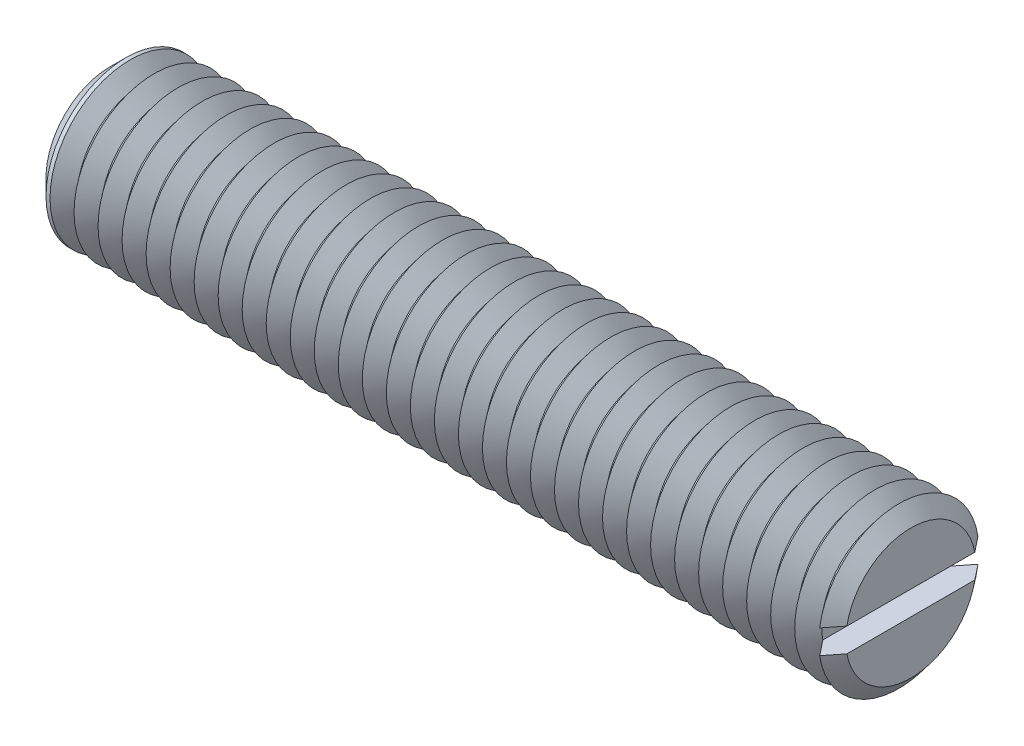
ISO-10303-21;
HEADER;
FILE_DESCRIPTION(('STEP AP214'),'2;1');
FILE_NAME('part.step','',(''),(''),'','','');
FILE_SCHEMA(('AUTOMOTIVE_DESIGN { 1 0 10303 214 1 1 1 1 }'));
ENDSEC;
DATA;
#1=APPLICATION_CONTEXT('core data for automotive mechanical design processes');
#2=APPLICATION_PROTOCOL_DEFINITION('international standard','automotive_design',2000,#1);
#3=PRODUCT_CONTEXT('',#1,'mechanical');
#4=PRODUCT('Part','Part','',(#3));
#5=PRODUCT_RELATED_PRODUCT_CATEGORY('part','',(#4));
#6=PRODUCT_DEFINITION_FORMATION('','',#4);
#7=PRODUCT_DEFINITION_CONTEXT('part definition',#1,'design');
#8=PRODUCT_DEFINITION('design','',#6,#7);
#9=PRODUCT_DEFINITION_SHAPE('','',#8);
#10=(LENGTH_UNIT() NAMED_UNIT(*) SI_UNIT(.MILLI.,.METRE.));
#11=(NAMED_UNIT(*) PLANE_ANGLE_UNIT() SI_UNIT($,.RADIAN.));
#12=(NAMED_UNIT(*) SI_UNIT($,.STERADIAN.) SOLID_ANGLE_UNIT());
#13=UNCERTAINTY_MEASURE_WITH_UNIT(LENGTH_MEASURE(1.E-05),#10,'distance_accuracy_value','');
#14=(GEOMETRIC_REPRESENTATION_CONTEXT(3) GLOBAL_UNCERTAINTY_ASSIGNED_CONTEXT((#13)) GLOBAL_UNIT_ASSIGNED_CONTEXT((#10,
#11,#12)) REPRESENTATION_CONTEXT('',''));
#15=CARTESIAN_POINT('',(0.,0.,0.));
#16=DIRECTION('',(0.,0.,1.));
#17=DIRECTION('',(1.,0.,0.));
#18=AXIS2_PLACEMENT_3D('',#15,#16,#17);
#19=CARTESIAN_POINT('',(24.25,0.,0.));
#20=DIRECTION('',(1.,0.,0.));
#21=DIRECTION('',(0.,0.,-1.));
#22=AXIS2_PLACEMENT_3D('',#19,#20,#21);
#23=CONICAL_SURFACE('',#22,5.,0.895664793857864);
#24=CARTESIAN_POINT('',(24.25,0.,0.));
#25=DIRECTION('',(-1.,0.,0.));
#26=DIRECTION('',(0.,0.,1.));
#27=AXIS2_PLACEMENT_3D('',#24,#25,#26);
#28=CIRCLE('',#27,5.);
#29=CARTESIAN_POINT('',(24.25,-0.75,-4.9434299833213));
#30=VERTEX_POINT('',#29);
#31=CARTESIAN_POINT('',(24.25,-0.75,4.9434299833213));
#32=VERTEX_POINT('',#31);
#33=EDGE_CURVE('E116',#30,#32,#28,.T.);
#34=ORIENTED_EDGE('',*,*,#33,.T.);
#35=CARTESIAN_POINT('',(28.9886555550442,-0.75,-10.8927895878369));
#36=CARTESIAN_POINT('',(28.678663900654,-0.75,-10.5046848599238));
#37=CARTESIAN_POINT('',(28.3687121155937,-0.75,-10.1165482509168));
#38=CARTESIAN_POINT('',(27.7489116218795,-0.75,-9.34012563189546));
#39=CARTESIAN_POINT('',(27.4390629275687,-0.75,-8.95183961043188));
#40=CARTESIAN_POINT('',(26.8189382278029,-0.75,-8.17433811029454));
#41=CARTESIAN_POINT('',(26.5086626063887,-0.75,-7.78512232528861));
#42=CARTESIAN_POINT('',(25.8884400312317,-0.75,-7.00649525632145));
#43=CARTESIAN_POINT('',(25.5784930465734,-0.75,-6.61708399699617));
#44=CARTESIAN_POINT('',(25.1053943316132,-0.75,-6.02191131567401));
#45=CARTESIAN_POINT('',(24.9420627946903,-0.75,-5.81629283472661));
#46=CARTESIAN_POINT('',(24.6155893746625,-0.75,-5.40490151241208));
#47=CARTESIAN_POINT('',(24.4524474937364,-0.75,-5.19912866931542));
#48=CARTESIAN_POINT('',(24.1263799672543,-0.75,-4.78730226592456));
#49=CARTESIAN_POINT('',(23.9634544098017,-0.75,-4.58124863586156));
#50=CARTESIAN_POINT('',(23.638006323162,-0.75,-4.16883695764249));
#51=CARTESIAN_POINT('',(23.4754837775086,-0.75,-3.9624789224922));
#52=CARTESIAN_POINT('',(23.1512888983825,-0.75,-3.54956515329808));
#53=CARTESIAN_POINT('',(22.9896156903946,-0.75,-3.3430101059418));
#54=CARTESIAN_POINT('',(22.6672688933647,-0.75,-2.92906737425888));
#55=CARTESIAN_POINT('',(22.5065954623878,-0.75,-2.72167956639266));
#56=CARTESIAN_POINT('',(22.2671162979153,-0.75,-2.40952296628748));
#57=CARTESIAN_POINT('',(22.187569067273,-0.75,-2.30532351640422));
#58=CARTESIAN_POINT('',(22.0292089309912,-0.75,-2.0963686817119));
#59=CARTESIAN_POINT('',(21.9503960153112,-0.75,-1.99161330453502));
#60=CARTESIAN_POINT('',(21.7939159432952,-0.75,-1.78128982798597));
#61=CARTESIAN_POINT('',(21.7162485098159,-0.75,-1.67572193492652));
#62=CARTESIAN_POINT('',(21.5627483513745,-0.75,-1.46326300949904));
#63=CARTESIAN_POINT('',(21.4869154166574,-0.75,-1.35637213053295));
#64=CARTESIAN_POINT('',(21.3961291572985,-0.75,-1.22407390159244));
#65=CARTESIAN_POINT('',(21.3795740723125,-0.75,-1.19976686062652));
#66=CARTESIAN_POINT('',(21.3466682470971,-0.75,-1.15101442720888));
#67=CARTESIAN_POINT('',(21.3303175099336,-0.75,-1.12656903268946));
#68=CARTESIAN_POINT('',(21.2816161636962,-0.75,-1.05299302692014));
#69=CARTESIAN_POINT('',(21.2496192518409,-0.75,-1.00362669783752));
#70=CARTESIAN_POINT('',(21.1868890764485,-0.75,-0.903957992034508));
#71=CARTESIAN_POINT('',(21.1561584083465,-0.75,-0.853653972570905));
#72=CARTESIAN_POINT('',(21.0966309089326,-0.75,-0.751913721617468));
#73=CARTESIAN_POINT('',(21.0678337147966,-0.75,-0.700477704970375));
#74=CARTESIAN_POINT('',(21.0225435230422,-0.75,-0.613963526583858));
#75=CARTESIAN_POINT('',(21.0052186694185,-0.75,-0.579327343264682));
#76=CARTESIAN_POINT('',(20.9722687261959,-0.75,-0.509265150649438));
#77=CARTESIAN_POINT('',(20.9566439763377,-0.75,-0.473838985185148));
#78=CARTESIAN_POINT('',(20.9132659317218,-0.75,-0.366382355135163));
#79=CARTESIAN_POINT('',(20.8888237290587,-0.75,-0.292842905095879));
#80=CARTESIAN_POINT('',(20.8658405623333,-0.75,-0.18980999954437));
#81=CARTESIAN_POINT('',(20.8606856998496,-0.75,-0.161782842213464));
#82=CARTESIAN_POINT('',(20.8527704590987,-0.75,-0.105398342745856));
#83=CARTESIAN_POINT('',(20.8500088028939,-0.75,-0.0770411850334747));
#84=CARTESIAN_POINT('',(20.8470684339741,-0.75,-0.020254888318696));
#85=CARTESIAN_POINT('',(20.8468839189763,-0.75,0.00817394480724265));
#86=CARTESIAN_POINT('',(20.8490950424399,-0.75,0.0649322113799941));
#87=CARTESIAN_POINT('',(20.851491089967,-0.75,0.0932616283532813));
#88=CARTESIAN_POINT('',(20.8596937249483,-0.75,0.157351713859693));
#89=CARTESIAN_POINT('',(20.8662565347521,-0.75,0.193015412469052));
#90=CARTESIAN_POINT('',(20.8827020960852,-0.75,0.263573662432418));
#91=CARTESIAN_POINT('',(20.8925874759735,-0.75,0.298467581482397));
#92=CARTESIAN_POINT('',(20.9150598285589,-0.75,0.367652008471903));
#93=CARTESIAN_POINT('',(20.9276667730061,-0.75,0.401935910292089));
#94=CARTESIAN_POINT('',(20.9549130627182,-0.75,0.469664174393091));
#95=CARTESIAN_POINT('',(20.9695519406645,-0.75,0.503108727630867));
#96=CARTESIAN_POINT('',(21.0166350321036,-0.75,0.604259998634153));
#97=CARTESIAN_POINT('',(21.051542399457,-0.75,0.670810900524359));
#98=CARTESIAN_POINT('',(21.1250588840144,-0.75,0.801849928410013));
#99=CARTESIAN_POINT('',(21.1636717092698,-0.75,0.866335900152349));
#100=CARTESIAN_POINT('',(21.2432739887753,-0.75,0.994050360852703));
#101=CARTESIAN_POINT('',(21.284269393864,-0.75,1.05727512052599));
#102=CARTESIAN_POINT('',(21.3677403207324,-0.75,1.18274150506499));
#103=CARTESIAN_POINT('',(21.4102160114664,-0.75,1.24498301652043));
#104=CARTESIAN_POINT('',(21.4963066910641,-0.75,1.36895722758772));
#105=CARTESIAN_POINT('',(21.5399248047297,-0.75,1.43068775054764));
#106=CARTESIAN_POINT('',(21.6278819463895,-0.75,1.55364126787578));
#107=CARTESIAN_POINT('',(21.672221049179,-0.75,1.61486420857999));
#108=CARTESIAN_POINT('',(21.7613408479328,-0.75,1.73681254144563));
#109=CARTESIAN_POINT('',(21.8061205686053,-0.75,1.79753864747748));
#110=CARTESIAN_POINT('',(21.8960732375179,-0.75,1.91869503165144));
#111=CARTESIAN_POINT('',(21.9412461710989,-0.75,1.9791253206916));
#112=CARTESIAN_POINT('',(22.076109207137,-0.75,2.15860363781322));
#113=CARTESIAN_POINT('',(22.1662359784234,-0.75,2.27732336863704));
#114=CARTESIAN_POINT('',(22.3472315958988,-0.75,2.51419617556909));
#115=CARTESIAN_POINT('',(22.4381004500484,-0.75,2.63234924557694));
#116=CARTESIAN_POINT('',(22.7114512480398,-0.75,2.98624879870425));
#117=CARTESIAN_POINT('',(22.8946699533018,-0.75,3.22142577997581));
#118=CARTESIAN_POINT('',(23.262238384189,-0.75,3.69117947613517));
#119=CARTESIAN_POINT('',(23.4465888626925,-0.75,3.92575559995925));
#120=CARTESIAN_POINT('',(23.81587911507,-0.75,4.39443534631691));
#121=CARTESIAN_POINT('',(24.000818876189,-0.75,4.62853897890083));
#122=CARTESIAN_POINT('',(24.370331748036,-0.75,5.09551589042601));
#123=CARTESIAN_POINT('',(24.5549033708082,-0.75,5.32839034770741));
#124=CARTESIAN_POINT('',(24.9242990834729,-0.75,5.79394105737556));
#125=CARTESIAN_POINT('',(25.1091231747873,-0.75,6.0266173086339));
#126=CARTESIAN_POINT('',(25.6637745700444,-0.75,6.72433690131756));
#127=CARTESIAN_POINT('',(26.0338620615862,-0.75,7.18917337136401));
#128=CARTESIAN_POINT('',(26.6190458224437,-0.75,7.92356230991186));
#129=CARTESIAN_POINT('',(26.8340169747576,-0.75,8.19321453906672));
#130=CARTESIAN_POINT('',(27.2640698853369,-0.75,8.73245662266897));
#131=CARTESIAN_POINT('',(27.479151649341,-0.75,9.00204647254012));
#132=CARTESIAN_POINT('',(27.9099436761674,-0.75,9.54186292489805));
#133=CARTESIAN_POINT('',(28.1256541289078,-0.75,9.8120893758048));
#134=CARTESIAN_POINT('',(28.5571210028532,-0.75,10.3524795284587));
#135=CARTESIAN_POINT('',(28.7728774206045,-0.75,10.6226432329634));
#136=CARTESIAN_POINT('',(28.9886555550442,-0.75,10.8927895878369));
#137=B_SPLINE_CURVE_WITH_KNOTS('',3,(#35,#36,#37,#38,#39,#40,#41,#42,#43,#44,#45,#46,#47,#48,
#49,#50,#51,#52,#53,#54,#55,#56,#57,#58,#59,#60,#61,#62,#63,#64,#65,#66,#67,#68,#69,#70,#71,#72,
#73,#74,#75,#76,#77,#78,#79,#80,#81,#82,#83,#84,#85,#86,#87,#88,#89,#90,#91,#92,#93,#94,#95,#96,
#97,#98,#99,#100,#101,#102,#103,#104,#105,#106,#107,#108,#109,#110,#111,#112,#113,#114,#115,
#116,#117,#118,#119,#120,#121,#122,#123,#124,#125,#126,#127,#128,#129,#130,#131,#132,#133,#134,
#135,#136),.UNSPECIFIED.,.F.,.F.,(4,2,2,2,2,2,2,2,2,2,2,2,2,2,2,2,2,2,2,2,2,2,2,2,2,2,2,2,2,2,2,
2,2,2,2,2,2,2,2,2,2,2,2,2,2,2,2,2,2,2,4),(0.,1.49012787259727,2.98041311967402,4.47367759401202,
5.96678625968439,6.7545712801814,7.54236526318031,8.3304167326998,9.1184354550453,
9.90534542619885,10.6923767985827,11.0856530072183,11.4789238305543,11.8720978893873,
12.265226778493,12.3534535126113,12.441681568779,12.6181526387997,12.7949690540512,
12.9717521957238,13.0878863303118,13.2040436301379,13.43522465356,13.5206311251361,
13.6059919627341,13.6911605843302,13.7763427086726,13.8849305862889,13.9936045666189,
14.1031049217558,14.2125801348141,14.4377857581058,14.6632191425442,14.8892420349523,
15.1152908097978,15.3420406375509,15.5688141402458,15.7951656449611,16.0215087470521,
16.4686664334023,16.91582892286,17.8101909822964,18.7052318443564,19.6002534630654,
20.4916985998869,21.3831487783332,23.1656575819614,24.2002223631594,25.2348477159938,
26.2721422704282,27.3093757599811),.UNSPECIFIED.);
#138=CARTESIAN_POINT('',(23.5,-0.75,3.99343248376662));
#139=VERTEX_POINT('',#138);
#140=EDGE_CURVE('E108',#139,#32,#137,.T.);
#141=ORIENTED_EDGE('',*,*,#140,.F.);
#142=CARTESIAN_POINT('',(23.5,0.,0.));
#143=DIRECTION('',(-1.,0.,0.));
#144=DIRECTION('',(0.,0.,1.));
#145=AXIS2_PLACEMENT_3D('',#142,#143,#144);
#146=CIRCLE('',#145,4.06325030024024);
#147=CARTESIAN_POINT('',(23.5,-0.75,-3.99343248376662));
#148=VERTEX_POINT('',#147);
#149=EDGE_CURVE('E480',#148,#139,#146,.T.);
#150=ORIENTED_EDGE('',*,*,#149,.F.);
#151=EDGE_CURVE('E57',#30,#148,#137,.T.);
#152=ORIENTED_EDGE('',*,*,#151,.F.);
#153=EDGE_LOOP('',(#34,#141,#150,#152));
#154=FACE_BOUND('',#153,.T.);
#155=ADVANCED_FACE('F36',(#154),#23,.T.);
#156=CARTESIAN_POINT('',(24.25,0.75,4.9434299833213));
#157=VERTEX_POINT('',#156);
#158=CARTESIAN_POINT('',(24.25,0.75,-4.9434299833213));
#159=VERTEX_POINT('',#158);
#160=EDGE_CURVE('E99',#157,#159,#28,.T.);
#161=ORIENTED_EDGE('',*,*,#160,.T.);
#162=CARTESIAN_POINT('',(28.9886555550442,0.75,10.8927895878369));
#163=CARTESIAN_POINT('',(28.678663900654,0.75,10.5046848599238));
#164=CARTESIAN_POINT('',(28.3687121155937,0.75,10.1165482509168));
#165=CARTESIAN_POINT('',(27.7489116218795,0.75,9.34012563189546));
#166=CARTESIAN_POINT('',(27.4390629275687,0.75,8.95183961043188));
#167=CARTESIAN_POINT('',(26.8189382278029,0.75,8.17433811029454));
#168=CARTESIAN_POINT('',(26.5086626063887,0.75,7.78512232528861));
#169=CARTESIAN_POINT('',(25.8884400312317,0.75,7.00649525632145));
#170=CARTESIAN_POINT('',(25.5784930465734,0.75,6.61708399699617));
#171=CARTESIAN_POINT('',(25.1053943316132,0.75,6.02191131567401));
#172=CARTESIAN_POINT('',(24.9420627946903,0.75,5.81629283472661));
#173=CARTESIAN_POINT('',(24.6155893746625,0.75,5.40490151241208));
#174=CARTESIAN_POINT('',(24.4524474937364,0.75,5.19912866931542));
#175=CARTESIAN_POINT('',(24.1263799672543,0.75,4.78730226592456));
#176=CARTESIAN_POINT('',(23.9634544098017,0.75,4.58124863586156));
#177=CARTESIAN_POINT('',(23.638006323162,0.75,4.16883695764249));
#178=CARTESIAN_POINT('',(23.4754837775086,0.75,3.9624789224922));
#179=CARTESIAN_POINT('',(23.1512888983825,0.75,3.54956515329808));
#180=CARTESIAN_POINT('',(22.9896156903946,0.75,3.3430101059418));
#181=CARTESIAN_POINT('',(22.6672688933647,0.75,2.92906737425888));
#182=CARTESIAN_POINT('',(22.5065954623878,0.75,2.72167956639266));
#183=CARTESIAN_POINT('',(22.2671162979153,0.75,2.40952296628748));
#184=CARTESIAN_POINT('',(22.187569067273,0.75,2.30532351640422));
#185=CARTESIAN_POINT('',(22.0292089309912,0.75,2.0963686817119));
#186=CARTESIAN_POINT('',(21.9503960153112,0.75,1.99161330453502));
#187=CARTESIAN_POINT('',(21.7939159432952,0.75,1.78128982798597));
#188=CARTESIAN_POINT('',(21.7162485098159,0.75,1.67572193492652));
#189=CARTESIAN_POINT('',(21.5627483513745,0.75,1.46326300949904));
#190=CARTESIAN_POINT('',(21.4869154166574,0.75,1.35637213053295));
#191=CARTESIAN_POINT('',(21.3961291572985,0.75,1.22407390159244));
#192=CARTESIAN_POINT('',(21.3795740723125,0.75,1.19976686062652));
#193=CARTESIAN_POINT('',(21.3466682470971,0.75,1.15101442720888));
#194=CARTESIAN_POINT('',(21.3303175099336,0.75,1.12656903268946));
#195=CARTESIAN_POINT('',(21.2816161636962,0.75,1.05299302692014));
#196=CARTESIAN_POINT('',(21.2496192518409,0.75,1.00362669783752));
#197=CARTESIAN_POINT('',(21.1868890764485,0.75,0.903957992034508));
#198=CARTESIAN_POINT('',(21.1561584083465,0.75,0.853653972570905));
#199=CARTESIAN_POINT('',(21.0966309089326,0.75,0.751913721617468));
#200=CARTESIAN_POINT('',(21.0678337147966,0.75,0.700477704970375));
#201=CARTESIAN_POINT('',(21.0225435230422,0.75,0.613963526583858));
#202=CARTESIAN_POINT('',(21.0052186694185,0.75,0.579327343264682));
#203=CARTESIAN_POINT('',(20.9722687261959,0.75,0.509265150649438));
#204=CARTESIAN_POINT('',(20.9566439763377,0.75,0.473838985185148));
#205=CARTESIAN_POINT('',(20.9132659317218,0.75,0.366382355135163));
#206=CARTESIAN_POINT('',(20.8888237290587,0.75,0.292842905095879));
#207=CARTESIAN_POINT('',(20.8658405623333,0.75,0.18980999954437));
#208=CARTESIAN_POINT('',(20.8606856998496,0.75,0.161782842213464));
#209=CARTESIAN_POINT('',(20.8527704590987,0.75,0.105398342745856));
#210=CARTESIAN_POINT('',(20.8500088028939,0.75,0.0770411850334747));
#211=CARTESIAN_POINT('',(20.8470684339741,0.75,0.020254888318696));
#212=CARTESIAN_POINT('',(20.8468839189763,0.75,-0.00817394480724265));
#213=CARTESIAN_POINT('',(20.8490950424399,0.75,-0.0649322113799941));
#214=CARTESIAN_POINT('',(20.851491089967,0.75,-0.0932616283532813));
#215=CARTESIAN_POINT('',(20.8596937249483,0.75,-0.157351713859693));
#216=CARTESIAN_POINT('',(20.8662565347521,0.75,-0.193015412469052));
#217=CARTESIAN_POINT('',(20.8827020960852,0.75,-0.263573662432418));
#218=CARTESIAN_POINT('',(20.8925874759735,0.75,-0.298467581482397));
#219=CARTESIAN_POINT('',(20.9150598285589,0.75,-0.367652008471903));
#220=CARTESIAN_POINT('',(20.9276667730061,0.75,-0.401935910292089));
#221=CARTESIAN_POINT('',(20.9549130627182,0.75,-0.469664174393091));
#222=CARTESIAN_POINT('',(20.9695519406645,0.75,-0.503108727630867));
#223=CARTESIAN_POINT('',(21.0166350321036,0.75,-0.604259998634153));
#224=CARTESIAN_POINT('',(21.051542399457,0.75,-0.670810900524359));
#225=CARTESIAN_POINT('',(21.1250588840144,0.75,-0.801849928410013));
#226=CARTESIAN_POINT('',(21.1636717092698,0.75,-0.866335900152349));
#227=CARTESIAN_POINT('',(21.2432739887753,0.75,-0.994050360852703));
#228=CARTESIAN_POINT('',(21.284269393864,0.75,-1.05727512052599));
#229=CARTESIAN_POINT('',(21.3677403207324,0.75,-1.18274150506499));
#230=CARTESIAN_POINT('',(21.4102160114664,0.75,-1.24498301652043));
#231=CARTESIAN_POINT('',(21.4963066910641,0.75,-1.36895722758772));
#232=CARTESIAN_POINT('',(21.5399248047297,0.75,-1.43068775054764));
#233=CARTESIAN_POINT('',(21.6278819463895,0.75,-1.55364126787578));
#234=CARTESIAN_POINT('',(21.672221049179,0.75,-1.61486420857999));
#235=CARTESIAN_POINT('',(21.7613408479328,0.75,-1.73681254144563));
#236=CARTESIAN_POINT('',(21.8061205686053,0.75,-1.79753864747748));
#237=CARTESIAN_POINT('',(21.8960732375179,0.75,-1.91869503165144));
#238=CARTESIAN_POINT('',(21.9412461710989,0.75,-1.9791253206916));
#239=CARTESIAN_POINT('',(22.076109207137,0.75,-2.15860363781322));
#240=CARTESIAN_POINT('',(22.1662359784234,0.75,-2.27732336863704));
#241=CARTESIAN_POINT('',(22.3472315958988,0.75,-2.51419617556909));
#242=CARTESIAN_POINT('',(22.4381004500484,0.75,-2.63234924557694));
#243=CARTESIAN_POINT('',(22.7114512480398,0.75,-2.98624879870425));
#244=CARTESIAN_POINT('',(22.8946699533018,0.75,-3.22142577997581));
#245=CARTESIAN_POINT('',(23.262238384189,0.75,-3.69117947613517));
#246=CARTESIAN_POINT('',(23.4465888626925,0.75,-3.92575559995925));
#247=CARTESIAN_POINT('',(23.81587911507,0.75,-4.39443534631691));
#248=CARTESIAN_POINT('',(24.000818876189,0.75,-4.62853897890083));
#249=CARTESIAN_POINT('',(24.370331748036,0.75,-5.09551589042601));
#250=CARTESIAN_POINT('',(24.5549033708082,0.75,-5.32839034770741));
#251=CARTESIAN_POINT('',(24.9242990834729,0.75,-5.79394105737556));
#252=CARTESIAN_POINT('',(25.1091231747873,0.75,-6.0266173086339));
#253=CARTESIAN_POINT('',(25.6637745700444,0.75,-6.72433690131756));
#254=CARTESIAN_POINT('',(26.0338620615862,0.75,-7.18917337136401));
#255=CARTESIAN_POINT('',(26.6190458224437,0.75,-7.92356230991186));
#256=CARTESIAN_POINT('',(26.8340169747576,0.75,-8.19321453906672));
#257=CARTESIAN_POINT('',(27.2640698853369,0.75,-8.73245662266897));
#258=CARTESIAN_POINT('',(27.479151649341,0.75,-9.00204647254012));
#259=CARTESIAN_POINT('',(27.9099436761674,0.75,-9.54186292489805));
#260=CARTESIAN_POINT('',(28.1256541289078,0.75,-9.8120893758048));
#261=CARTESIAN_POINT('',(28.5571210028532,0.75,-10.3524795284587));
#262=CARTESIAN_POINT('',(28.7728774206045,0.75,-10.6226432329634));
#263=CARTESIAN_POINT('',(28.9886555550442,0.75,-10.8927895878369));
#264=B_SPLINE_CURVE_WITH_KNOTS('',3,(#162,#163,#164,#165,#166,#167,#168,#169,#170,#171,#172,
#173,#174,#175,#176,#177,#178,#179,#180,#181,#182,#183,#184,#185,#186,#187,#188,#189,#190,#191,
#192,#193,#194,#195,#196,#197,#198,#199,#200,#201,#202,#203,#204,#205,#206,#207,#208,#209,#210,
#211,#212,#213,#214,#215,#216,#217,#218,#219,#220,#221,#222,#223,#224,#225,#226,#227,#228,#229,
#230,#231,#232,#233,#234,#235,#236,#237,#238,#239,#240,#241,#242,#243,#244,#245,#246,#247,#248,
#249,#250,#251,#252,#253,#254,#255,#256,#257,#258,#259,#260,#261,#262,#263),.UNSPECIFIED.,.F.,
.F.,(4,2,2,2,2,2,2,2,2,2,2,2,2,2,2,2,2,2,2,2,2,2,2,2,2,2,2,2,2,2,2,2,2,2,2,2,2,2,2,2,2,2,2,2,2,
2,2,2,2,2,4),(0.,1.49012787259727,2.98041311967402,4.47367759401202,5.96678625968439,
6.7545712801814,7.54236526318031,8.3304167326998,9.1184354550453,9.90534542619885,
10.6923767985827,11.0856530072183,11.4789238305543,11.8720978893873,12.265226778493,
12.3534535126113,12.441681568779,12.6181526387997,12.7949690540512,12.9717521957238,
13.0878863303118,13.2040436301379,13.43522465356,13.5206311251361,13.6059919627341,
13.6911605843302,13.7763427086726,13.8849305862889,13.9936045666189,14.1031049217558,
14.2125801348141,14.4377857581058,14.6632191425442,14.8892420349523,15.1152908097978,
15.3420406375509,15.5688141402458,15.7951656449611,16.0215087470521,16.4686664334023,
16.91582892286,17.8101909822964,18.7052318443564,19.6002534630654,20.4916985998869,
21.3831487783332,23.1656575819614,24.2002223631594,25.2348477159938,26.2721422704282,
27.3093757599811),.UNSPECIFIED.);
#265=CARTESIAN_POINT('',(23.5,0.75,-3.99343248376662));
#266=VERTEX_POINT('',#265);
#267=EDGE_CURVE('E109',#266,#159,#264,.T.);
#268=ORIENTED_EDGE('',*,*,#267,.F.);
#269=CARTESIAN_POINT('',(23.5,0.75,3.99343248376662));
#270=VERTEX_POINT('',#269);
#271=EDGE_CURVE('E102',#270,#266,#146,.T.);
#272=ORIENTED_EDGE('',*,*,#271,.F.);
#273=EDGE_CURVE('E96',#157,#270,#264,.T.);
#274=ORIENTED_EDGE('',*,*,#273,.F.);
#275=EDGE_LOOP('',(#161,#268,#272,#274));
#276=FACE_BOUND('',#275,.T.);
#277=ADVANCED_FACE('F98',(#276),#23,.T.);
#278=CARTESIAN_POINT('',(23.5,0.,0.));
#279=DIRECTION('',(-1.,0.,0.));
#280=DIRECTION('',(0.,0.,1.));
#281=AXIS2_PLACEMENT_3D('',#278,#279,#280);
#282=CONICAL_SURFACE('',#281,4.06325030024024,0.895664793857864);
#283=CARTESIAN_POINT('',(22.75,0.,0.));
#284=DIRECTION('',(-1.,0.,0.));
#285=DIRECTION('',(0.,0.,1.));
#286=AXIS2_PLACEMENT_3D('',#283,#284,#285);
#287=CIRCLE('',#286,5.);
#288=CARTESIAN_POINT('',(22.75,0.,5.));
#289=VERTEX_POINT('',#288);
#290=EDGE_CURVE('E465',#289,#289,#287,.T.);
#291=ORIENTED_EDGE('',*,*,#290,.F.);
#292=EDGE_LOOP('',(#291));
#293=FACE_BOUND('',#292,.T.);
#294=ORIENTED_EDGE('',*,*,#271,.T.);
#295=EDGE_CURVE('E474',#266,#148,#146,.T.);
#296=ORIENTED_EDGE('',*,*,#295,.T.);
#297=ORIENTED_EDGE('',*,*,#149,.T.);
#298=EDGE_CURVE('E472',#139,#270,#146,.T.);
#299=ORIENTED_EDGE('',*,*,#298,.T.);
#300=EDGE_LOOP('',(#294,#296,#297,#299));
#301=FACE_BOUND('',#300,.T.);
#302=ADVANCED_FACE('F166',(#293,#301),#282,.T.);
#303=CARTESIAN_POINT('',(25.,0.,0.));
#304=DIRECTION('',(1.,0.,0.));
#305=DIRECTION('',(0.,0.,-1.));
#306=AXIS2_PLACEMENT_3D('',#303,#304,#305);
#307=PLANE('',#306);
#308=CARTESIAN_POINT('',(25.,0.,0.));
#309=DIRECTION('',(-1.,0.,0.));
#310=DIRECTION('',(0.,0.,1.));
#311=AXIS2_PLACEMENT_3D('',#308,#309,#310);
#312=CIRCLE('',#311,4.06325030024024);
#313=CARTESIAN_POINT('',(25.,0.75,3.99343248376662));
#314=VERTEX_POINT('',#313);
#315=CARTESIAN_POINT('',(25.,0.75,-3.99343248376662));
#316=VERTEX_POINT('',#315);
#317=EDGE_CURVE('E158',#314,#316,#312,.T.);
#318=ORIENTED_EDGE('',*,*,#317,.F.);
#319=DIRECTION('',(0.,0.,1.));
#320=VECTOR('',#319,1.);
#321=CARTESIAN_POINT('',(25.,0.75,0.));
#322=LINE('',#321,#320);
#323=EDGE_CURVE('E121',#316,#314,#322,.T.);
#324=ORIENTED_EDGE('',*,*,#323,.F.);
#325=EDGE_LOOP('',(#318,#324));
#326=FACE_BOUND('',#325,.T.);
#327=ADVANCED_FACE('F170',(#326),#307,.T.);
#328=CARTESIAN_POINT('',(25.,-0.75,-3.99343248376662));
#329=VERTEX_POINT('',#328);
#330=CARTESIAN_POINT('',(25.,-0.75,3.99343248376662));
#331=VERTEX_POINT('',#330);
#332=EDGE_CURVE('E65',#329,#331,#312,.T.);
#333=ORIENTED_EDGE('',*,*,#332,.F.);
#334=DIRECTION('',(0.,0.,-1.));
#335=VECTOR('',#334,1.);
#336=CARTESIAN_POINT('',(25.,-0.75,0.));
#337=LINE('',#336,#335);
#338=EDGE_CURVE('E135',#331,#329,#337,.T.);
#339=ORIENTED_EDGE('',*,*,#338,.F.);
#340=EDGE_LOOP('',(#333,#339));
#341=FACE_BOUND('',#340,.T.);
#342=ADVANCED_FACE('F199',(#341),#307,.T.);
#343=CARTESIAN_POINT('',(25.,0.,0.));
#344=DIRECTION('',(-1.,0.,0.));
#345=DIRECTION('',(0.,0.,1.));
#346=AXIS2_PLACEMENT_3D('',#343,#344,#345);
#347=CONICAL_SURFACE('',#346,4.06325030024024,0.895664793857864);
#348=ORIENTED_EDGE('',*,*,#160,.F.);
#349=CARTESIAN_POINT('',(19.5113444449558,0.75,-10.8927895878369));
#350=CARTESIAN_POINT('',(19.821336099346,0.75,-10.5046848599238));
#351=CARTESIAN_POINT('',(20.1312878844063,0.75,-10.1165482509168));
#352=CARTESIAN_POINT('',(20.7510883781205,0.75,-9.34012563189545));
#353=CARTESIAN_POINT('',(21.0609370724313,0.75,-8.95183961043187));
#354=CARTESIAN_POINT('',(21.6810617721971,0.75,-8.17433811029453));
#355=CARTESIAN_POINT('',(21.9913373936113,0.75,-7.7851223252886));
#356=CARTESIAN_POINT('',(22.6115599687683,0.75,-7.00649525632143));
#357=CARTESIAN_POINT('',(22.9215069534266,0.75,-6.61708399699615));
#358=CARTESIAN_POINT('',(23.3946056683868,0.75,-6.021911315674));
#359=CARTESIAN_POINT('',(23.5579372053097,0.75,-5.8162928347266));
#360=CARTESIAN_POINT('',(23.8844106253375,0.75,-5.40490151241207));
#361=CARTESIAN_POINT('',(24.0475525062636,0.75,-5.19912866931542));
#362=CARTESIAN_POINT('',(24.3736200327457,0.75,-4.78730226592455));
#363=CARTESIAN_POINT('',(24.5365455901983,0.75,-4.58124863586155));
#364=CARTESIAN_POINT('',(24.861993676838,0.75,-4.16883695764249));
#365=CARTESIAN_POINT('',(25.0245162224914,0.75,-3.9624789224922));
#366=CARTESIAN_POINT('',(25.3487111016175,0.75,-3.54956515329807));
#367=CARTESIAN_POINT('',(25.5103843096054,0.75,-3.3430101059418));
#368=CARTESIAN_POINT('',(25.8327311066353,0.75,-2.92906737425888));
#369=CARTESIAN_POINT('',(25.9934045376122,0.75,-2.72167956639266));
#370=CARTESIAN_POINT('',(26.2328837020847,0.75,-2.40952296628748));
#371=CARTESIAN_POINT('',(26.312430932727,0.75,-2.30532351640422));
#372=CARTESIAN_POINT('',(26.4707910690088,0.75,-2.09636868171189));
#373=CARTESIAN_POINT('',(26.5496039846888,0.75,-1.99161330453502));
#374=CARTESIAN_POINT('',(26.7060840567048,0.75,-1.78128982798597));
#375=CARTESIAN_POINT('',(26.7837514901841,0.75,-1.67572193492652));
#376=CARTESIAN_POINT('',(26.9372516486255,0.75,-1.46326300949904));
#377=CARTESIAN_POINT('',(27.0130845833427,0.75,-1.35637213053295));
#378=CARTESIAN_POINT('',(27.1038708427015,0.75,-1.22407390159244));
#379=CARTESIAN_POINT('',(27.1204259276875,0.75,-1.19976686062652));
#380=CARTESIAN_POINT('',(27.1533317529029,0.75,-1.15101442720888));
#381=CARTESIAN_POINT('',(27.1696824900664,0.75,-1.12656903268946));
#382=CARTESIAN_POINT('',(27.2183838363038,0.75,-1.05299302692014));
#383=CARTESIAN_POINT('',(27.2503807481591,0.75,-1.00362669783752));
#384=CARTESIAN_POINT('',(27.3131109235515,0.75,-0.903957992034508));
#385=CARTESIAN_POINT('',(27.3438415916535,0.75,-0.853653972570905));
#386=CARTESIAN_POINT('',(27.4033690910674,0.75,-0.751913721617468));
#387=CARTESIAN_POINT('',(27.4321662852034,0.75,-0.700477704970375));
#388=CARTESIAN_POINT('',(27.4774564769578,0.75,-0.613963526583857));
#389=CARTESIAN_POINT('',(27.4947813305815,0.75,-0.579327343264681));
#390=CARTESIAN_POINT('',(27.5277312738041,0.75,-0.509265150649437));
#391=CARTESIAN_POINT('',(27.5433560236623,0.75,-0.473838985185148));
#392=CARTESIAN_POINT('',(27.5867340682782,0.75,-0.366382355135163));
#393=CARTESIAN_POINT('',(27.6111762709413,0.75,-0.292842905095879));
#394=CARTESIAN_POINT('',(27.6341594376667,0.75,-0.18980999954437));
#395=CARTESIAN_POINT('',(27.6393143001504,0.75,-0.161782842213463));
#396=CARTESIAN_POINT('',(27.6472295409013,0.75,-0.105398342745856));
#397=CARTESIAN_POINT('',(27.6499911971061,0.75,-0.0770411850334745));
#398=CARTESIAN_POINT('',(27.6529315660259,0.75,-0.0202548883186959));
#399=CARTESIAN_POINT('',(27.6531160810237,0.75,0.00817394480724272));
#400=CARTESIAN_POINT('',(27.6509049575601,0.75,0.0649322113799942));
#401=CARTESIAN_POINT('',(27.648508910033,0.75,0.0932616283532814));
#402=CARTESIAN_POINT('',(27.6403062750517,0.75,0.157351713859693));
#403=CARTESIAN_POINT('',(27.6337434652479,0.75,0.193015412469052));
#404=CARTESIAN_POINT('',(27.6172979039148,0.75,0.263573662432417));
#405=CARTESIAN_POINT('',(27.6074125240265,0.75,0.298467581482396));
#406=CARTESIAN_POINT('',(27.5849401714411,0.75,0.367652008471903));
#407=CARTESIAN_POINT('',(27.5723332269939,0.75,0.401935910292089));
#408=CARTESIAN_POINT('',(27.5450869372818,0.75,0.469664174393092));
#409=CARTESIAN_POINT('',(27.5304480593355,0.75,0.503108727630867));
#410=CARTESIAN_POINT('',(27.4833649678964,0.75,0.604259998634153));
#411=CARTESIAN_POINT('',(27.448457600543,0.75,0.67081090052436));
#412=CARTESIAN_POINT('',(27.3749411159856,0.75,0.801849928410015));
#413=CARTESIAN_POINT('',(27.3363282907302,0.75,0.86633590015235));
#414=CARTESIAN_POINT('',(27.2567260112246,0.75,0.994050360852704));
#415=CARTESIAN_POINT('',(27.2157306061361,0.75,1.057275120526));
#416=CARTESIAN_POINT('',(27.1322596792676,0.75,1.18274150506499));
#417=CARTESIAN_POINT('',(27.0897839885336,0.75,1.24498301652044));
#418=CARTESIAN_POINT('',(27.0036933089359,0.75,1.36895722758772));
#419=CARTESIAN_POINT('',(26.9600751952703,0.75,1.43068775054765));
#420=CARTESIAN_POINT('',(26.8721180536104,0.75,1.55364126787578));
#421=CARTESIAN_POINT('',(26.827778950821,0.75,1.61486420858));
#422=CARTESIAN_POINT('',(26.7386591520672,0.75,1.73681254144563));
#423=CARTESIAN_POINT('',(26.6938794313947,0.75,1.79753864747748));
#424=CARTESIAN_POINT('',(26.6039267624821,0.75,1.91869503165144));
#425=CARTESIAN_POINT('',(26.5587538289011,0.75,1.9791253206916));
#426=CARTESIAN_POINT('',(26.423890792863,0.75,2.15860363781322));
#427=CARTESIAN_POINT('',(26.3337640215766,0.75,2.27732336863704));
#428=CARTESIAN_POINT('',(26.1527684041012,0.75,2.51419617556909));
#429=CARTESIAN_POINT('',(26.0618995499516,0.75,2.63234924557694));
#430=CARTESIAN_POINT('',(25.7885487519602,0.75,2.98624879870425));
#431=CARTESIAN_POINT('',(25.6053300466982,0.75,3.22142577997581));
#432=CARTESIAN_POINT('',(25.237761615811,0.75,3.69117947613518));
#433=CARTESIAN_POINT('',(25.0534111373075,0.75,3.92575559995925));
#434=CARTESIAN_POINT('',(24.68412088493,0.75,4.39443534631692));
#435=CARTESIAN_POINT('',(24.499181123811,0.75,4.62853897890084));
#436=CARTESIAN_POINT('',(24.129668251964,0.75,5.09551589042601));
#437=CARTESIAN_POINT('',(23.9450966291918,0.75,5.32839034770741));
#438=CARTESIAN_POINT('',(23.5757009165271,0.75,5.79394105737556));
#439=CARTESIAN_POINT('',(23.3908768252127,0.75,6.0266173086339));
#440=CARTESIAN_POINT('',(22.8362254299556,0.75,6.72433690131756));
#441=CARTESIAN_POINT('',(22.4661379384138,0.75,7.18917337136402));
#442=CARTESIAN_POINT('',(21.8809541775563,0.75,7.92356230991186));
#443=CARTESIAN_POINT('',(21.6659830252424,0.75,8.19321453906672));
#444=CARTESIAN_POINT('',(21.2359301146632,0.75,8.73245662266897));
#445=CARTESIAN_POINT('',(21.020848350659,0.75,9.00204647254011));
#446=CARTESIAN_POINT('',(20.5900563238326,0.75,9.54186292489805));
#447=CARTESIAN_POINT('',(20.3743458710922,0.75,9.8120893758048));
#448=CARTESIAN_POINT('',(19.9428789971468,0.75,10.3524795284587));
#449=CARTESIAN_POINT('',(19.7271225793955,0.75,10.6226432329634));
#450=CARTESIAN_POINT('',(19.5113444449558,0.75,10.8927895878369));
#451=B_SPLINE_CURVE_WITH_KNOTS('',3,(#349,#350,#351,#352,#353,#354,#355,#356,#357,#358,#359,
#360,#361,#362,#363,#364,#365,#366,#367,#368,#369,#370,#371,#372,#373,#374,#375,#376,#377,#378,
#379,#380,#381,#382,#383,#384,#385,#386,#387,#388,#389,#390,#391,#392,#393,#394,#395,#396,#397,
#398,#399,#400,#401,#402,#403,#404,#405,#406,#407,#408,#409,#410,#411,#412,#413,#414,#415,#416,
#417,#418,#419,#420,#421,#422,#423,#424,#425,#426,#427,#428,#429,#430,#431,#432,#433,#434,#435,
#436,#437,#438,#439,#440,#441,#442,#443,#444,#445,#446,#447,#448,#449,#450),.UNSPECIFIED.,.F.,
.F.,(4,2,2,2,2,2,2,2,2,2,2,2,2,2,2,2,2,2,2,2,2,2,2,2,2,2,2,2,2,2,2,2,2,2,2,2,2,2,2,2,2,2,2,2,2,
2,2,2,2,2,4),(0.,1.49012787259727,2.98041311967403,4.47367759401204,5.9667862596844,
6.75457128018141,7.54236526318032,8.3304167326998,9.1184354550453,9.90534542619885,
10.6923767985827,11.0856530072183,11.4789238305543,11.8720978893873,12.265226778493,
12.3534535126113,12.441681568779,12.6181526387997,12.7949690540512,12.9717521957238,
13.0878863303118,13.2040436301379,13.43522465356,13.5206311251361,13.6059919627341,
13.6911605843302,13.7763427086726,13.8849305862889,13.9936045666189,14.1031049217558,
14.2125801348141,14.4377857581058,14.6632191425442,14.8892420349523,15.1152908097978,
15.3420406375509,15.5688141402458,15.7951656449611,16.0215087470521,16.4686664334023,
16.91582892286,17.8101909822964,18.7052318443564,19.6002534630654,20.4916985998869,
21.3831487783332,23.1656575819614,24.2002223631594,25.2348477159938,26.2721422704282,
27.3093757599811),.UNSPECIFIED.);
#452=EDGE_CURVE('E40',#314,#157,#451,.T.);
#453=ORIENTED_EDGE('',*,*,#452,.F.);
#454=ORIENTED_EDGE('',*,*,#317,.T.);
#455=EDGE_CURVE('E11',#159,#316,#451,.T.);
#456=ORIENTED_EDGE('',*,*,#455,.F.);
#457=EDGE_LOOP('',(#348,#453,#454,#456));
#458=FACE_BOUND('',#457,.T.);
#459=ADVANCED_FACE('F113',(#458),#347,.T.);
#460=CARTESIAN_POINT('',(25.,0.75,-7.5));
#461=DIRECTION('',(0.,1.,0.));
#462=DIRECTION('',(0.,0.,1.));
#463=AXIS2_PLACEMENT_3D('',#460,#461,#462);
#464=PLANE('',#463);
#465=ORIENTED_EDGE('',*,*,#452,.T.);
#466=ORIENTED_EDGE('',*,*,#273,.T.);
#467=DIRECTION('',(0.,0.,1.));
#468=VECTOR('',#467,1.);
#469=CARTESIAN_POINT('',(23.5,0.75,-7.5));
#470=LINE('',#469,#468);
#471=EDGE_CURVE('E143',#266,#270,#470,.T.);
#472=ORIENTED_EDGE('',*,*,#471,.F.);
#473=ORIENTED_EDGE('',*,*,#267,.T.);
#474=ORIENTED_EDGE('',*,*,#455,.T.);
#475=ORIENTED_EDGE('',*,*,#323,.T.);
#476=EDGE_LOOP('',(#465,#466,#472,#473,#474,#475));
#477=FACE_BOUND('',#476,.T.);
#478=ADVANCED_FACE('F119',(#477),#464,.F.);
#479=ORIENTED_EDGE('',*,*,#33,.F.);
#480=CARTESIAN_POINT('',(19.5113444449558,-0.75,10.8927895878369));
#481=CARTESIAN_POINT('',(19.821336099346,-0.75,10.5046848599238));
#482=CARTESIAN_POINT('',(20.1312878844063,-0.75,10.1165482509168));
#483=CARTESIAN_POINT('',(20.7510883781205,-0.75,9.34012563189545));
#484=CARTESIAN_POINT('',(21.0609370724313,-0.75,8.95183961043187));
#485=CARTESIAN_POINT('',(21.6810617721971,-0.75,8.17433811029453));
#486=CARTESIAN_POINT('',(21.9913373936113,-0.75,7.7851223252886));
#487=CARTESIAN_POINT('',(22.6115599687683,-0.75,7.00649525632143));
#488=CARTESIAN_POINT('',(22.9215069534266,-0.75,6.61708399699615));
#489=CARTESIAN_POINT('',(23.3946056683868,-0.75,6.021911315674));
#490=CARTESIAN_POINT('',(23.5579372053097,-0.75,5.8162928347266));
#491=CARTESIAN_POINT('',(23.8844106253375,-0.75,5.40490151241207));
#492=CARTESIAN_POINT('',(24.0475525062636,-0.75,5.19912866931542));
#493=CARTESIAN_POINT('',(24.3736200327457,-0.75,4.78730226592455));
#494=CARTESIAN_POINT('',(24.5365455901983,-0.75,4.58124863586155));
#495=CARTESIAN_POINT('',(24.861993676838,-0.75,4.16883695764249));
#496=CARTESIAN_POINT('',(25.0245162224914,-0.75,3.9624789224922));
#497=CARTESIAN_POINT('',(25.3487111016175,-0.75,3.54956515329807));
#498=CARTESIAN_POINT('',(25.5103843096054,-0.75,3.3430101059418));
#499=CARTESIAN_POINT('',(25.8327311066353,-0.75,2.92906737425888));
#500=CARTESIAN_POINT('',(25.9934045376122,-0.75,2.72167956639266));
#501=CARTESIAN_POINT('',(26.2328837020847,-0.75,2.40952296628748));
#502=CARTESIAN_POINT('',(26.312430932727,-0.75,2.30532351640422));
#503=CARTESIAN_POINT('',(26.4707910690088,-0.75,2.09636868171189));
#504=CARTESIAN_POINT('',(26.5496039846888,-0.75,1.99161330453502));
#505=CARTESIAN_POINT('',(26.7060840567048,-0.75,1.78128982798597));
#506=CARTESIAN_POINT('',(26.7837514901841,-0.75,1.67572193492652));
#507=CARTESIAN_POINT('',(26.9372516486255,-0.75,1.46326300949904));
#508=CARTESIAN_POINT('',(27.0130845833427,-0.75,1.35637213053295));
#509=CARTESIAN_POINT('',(27.1038708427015,-0.75,1.22407390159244));
#510=CARTESIAN_POINT('',(27.1204259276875,-0.75,1.19976686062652));
#511=CARTESIAN_POINT('',(27.1533317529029,-0.75,1.15101442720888));
#512=CARTESIAN_POINT('',(27.1696824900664,-0.75,1.12656903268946));
#513=CARTESIAN_POINT('',(27.2183838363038,-0.75,1.05299302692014));
#514=CARTESIAN_POINT('',(27.2503807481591,-0.75,1.00362669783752));
#515=CARTESIAN_POINT('',(27.3131109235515,-0.75,0.903957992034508));
#516=CARTESIAN_POINT('',(27.3438415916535,-0.75,0.853653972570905));
#517=CARTESIAN_POINT('',(27.4033690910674,-0.75,0.751913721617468));
#518=CARTESIAN_POINT('',(27.4321662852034,-0.75,0.700477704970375));
#519=CARTESIAN_POINT('',(27.4774564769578,-0.75,0.613963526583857));
#520=CARTESIAN_POINT('',(27.4947813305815,-0.75,0.579327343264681));
#521=CARTESIAN_POINT('',(27.5277312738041,-0.75,0.509265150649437));
#522=CARTESIAN_POINT('',(27.5433560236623,-0.75,0.473838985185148));
#523=CARTESIAN_POINT('',(27.5867340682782,-0.75,0.366382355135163));
#524=CARTESIAN_POINT('',(27.6111762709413,-0.75,0.292842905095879));
#525=CARTESIAN_POINT('',(27.6341594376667,-0.75,0.18980999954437));
#526=CARTESIAN_POINT('',(27.6393143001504,-0.75,0.161782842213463));
#527=CARTESIAN_POINT('',(27.6472295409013,-0.75,0.105398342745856));
#528=CARTESIAN_POINT('',(27.6499911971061,-0.75,0.0770411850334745));
#529=CARTESIAN_POINT('',(27.6529315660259,-0.75,0.0202548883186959));
#530=CARTESIAN_POINT('',(27.6531160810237,-0.75,-0.00817394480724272));
#531=CARTESIAN_POINT('',(27.6509049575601,-0.75,-0.0649322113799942));
#532=CARTESIAN_POINT('',(27.648508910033,-0.75,-0.0932616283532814));
#533=CARTESIAN_POINT('',(27.6403062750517,-0.75,-0.157351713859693));
#534=CARTESIAN_POINT('',(27.6337434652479,-0.75,-0.193015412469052));
#535=CARTESIAN_POINT('',(27.6172979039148,-0.75,-0.263573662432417));
#536=CARTESIAN_POINT('',(27.6074125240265,-0.75,-0.298467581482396));
#537=CARTESIAN_POINT('',(27.5849401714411,-0.75,-0.367652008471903));
#538=CARTESIAN_POINT('',(27.5723332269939,-0.75,-0.401935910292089));
#539=CARTESIAN_POINT('',(27.5450869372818,-0.75,-0.469664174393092));
#540=CARTESIAN_POINT('',(27.5304480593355,-0.75,-0.503108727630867));
#541=CARTESIAN_POINT('',(27.4833649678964,-0.75,-0.604259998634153));
#542=CARTESIAN_POINT('',(27.448457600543,-0.75,-0.67081090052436));
#543=CARTESIAN_POINT('',(27.3749411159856,-0.75,-0.801849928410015));
#544=CARTESIAN_POINT('',(27.3363282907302,-0.75,-0.86633590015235));
#545=CARTESIAN_POINT('',(27.2567260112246,-0.75,-0.994050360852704));
#546=CARTESIAN_POINT('',(27.2157306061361,-0.75,-1.057275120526));
#547=CARTESIAN_POINT('',(27.1322596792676,-0.75,-1.18274150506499));
#548=CARTESIAN_POINT('',(27.0897839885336,-0.75,-1.24498301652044));
#549=CARTESIAN_POINT('',(27.0036933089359,-0.75,-1.36895722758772));
#550=CARTESIAN_POINT('',(26.9600751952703,-0.75,-1.43068775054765));
#551=CARTESIAN_POINT('',(26.8721180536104,-0.75,-1.55364126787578));
#552=CARTESIAN_POINT('',(26.827778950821,-0.75,-1.61486420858));
#553=CARTESIAN_POINT('',(26.7386591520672,-0.75,-1.73681254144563));
#554=CARTESIAN_POINT('',(26.6938794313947,-0.75,-1.79753864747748));
#555=CARTESIAN_POINT('',(26.6039267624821,-0.75,-1.91869503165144));
#556=CARTESIAN_POINT('',(26.5587538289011,-0.75,-1.9791253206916));
#557=CARTESIAN_POINT('',(26.423890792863,-0.75,-2.15860363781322));
#558=CARTESIAN_POINT('',(26.3337640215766,-0.75,-2.27732336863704));
#559=CARTESIAN_POINT('',(26.1527684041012,-0.75,-2.51419617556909));
#560=CARTESIAN_POINT('',(26.0618995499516,-0.75,-2.63234924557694));
#561=CARTESIAN_POINT('',(25.7885487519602,-0.75,-2.98624879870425));
#562=CARTESIAN_POINT('',(25.6053300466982,-0.75,-3.22142577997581));
#563=CARTESIAN_POINT('',(25.237761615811,-0.75,-3.69117947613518));
#564=CARTESIAN_POINT('',(25.0534111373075,-0.75,-3.92575559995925));
#565=CARTESIAN_POINT('',(24.68412088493,-0.75,-4.39443534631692));
#566=CARTESIAN_POINT('',(24.499181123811,-0.75,-4.62853897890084));
#567=CARTESIAN_POINT('',(24.129668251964,-0.75,-5.09551589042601));
#568=CARTESIAN_POINT('',(23.9450966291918,-0.75,-5.32839034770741));
#569=CARTESIAN_POINT('',(23.5757009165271,-0.75,-5.79394105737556));
#570=CARTESIAN_POINT('',(23.3908768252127,-0.75,-6.0266173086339));
#571=CARTESIAN_POINT('',(22.8362254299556,-0.75,-6.72433690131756));
#572=CARTESIAN_POINT('',(22.4661379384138,-0.75,-7.18917337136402));
#573=CARTESIAN_POINT('',(21.8809541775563,-0.75,-7.92356230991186));
#574=CARTESIAN_POINT('',(21.6659830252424,-0.75,-8.19321453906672));
#575=CARTESIAN_POINT('',(21.2359301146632,-0.75,-8.73245662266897));
#576=CARTESIAN_POINT('',(21.020848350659,-0.75,-9.00204647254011));
#577=CARTESIAN_POINT('',(20.5900563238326,-0.75,-9.54186292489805));
#578=CARTESIAN_POINT('',(20.3743458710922,-0.75,-9.8120893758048));
#579=CARTESIAN_POINT('',(19.9428789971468,-0.75,-10.3524795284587));
#580=CARTESIAN_POINT('',(19.7271225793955,-0.75,-10.6226432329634));
#581=CARTESIAN_POINT('',(19.5113444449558,-0.75,-10.8927895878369));
#582=B_SPLINE_CURVE_WITH_KNOTS('',3,(#480,#481,#482,#483,#484,#485,#486,#487,#488,#489,#490,
#491,#492,#493,#494,#495,#496,#497,#498,#499,#500,#501,#502,#503,#504,#505,#506,#507,#508,#509,
#510,#511,#512,#513,#514,#515,#516,#517,#518,#519,#520,#521,#522,#523,#524,#525,#526,#527,#528,
#529,#530,#531,#532,#533,#534,#535,#536,#537,#538,#539,#540,#541,#542,#543,#544,#545,#546,#547,
#548,#549,#550,#551,#552,#553,#554,#555,#556,#557,#558,#559,#560,#561,#562,#563,#564,#565,#566,
#567,#568,#569,#570,#571,#572,#573,#574,#575,#576,#577,#578,#579,#580,#581),.UNSPECIFIED.,.F.,
.F.,(4,2,2,2,2,2,2,2,2,2,2,2,2,2,2,2,2,2,2,2,2,2,2,2,2,2,2,2,2,2,2,2,2,2,2,2,2,2,2,2,2,2,2,2,2,
2,2,2,2,2,4),(0.,1.49012787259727,2.98041311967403,4.47367759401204,5.9667862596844,
6.75457128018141,7.54236526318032,8.3304167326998,9.1184354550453,9.90534542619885,
10.6923767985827,11.0856530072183,11.4789238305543,11.8720978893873,12.265226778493,
12.3534535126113,12.441681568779,12.6181526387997,12.7949690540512,12.9717521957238,
13.0878863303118,13.2040436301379,13.43522465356,13.5206311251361,13.6059919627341,
13.6911605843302,13.7763427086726,13.8849305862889,13.9936045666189,14.1031049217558,
14.2125801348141,14.4377857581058,14.6632191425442,14.8892420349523,15.1152908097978,
15.3420406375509,15.5688141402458,15.7951656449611,16.0215087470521,16.4686664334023,
16.91582892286,17.8101909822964,18.7052318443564,19.6002534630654,20.4916985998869,
21.3831487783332,23.1656575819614,24.2002223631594,25.2348477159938,26.2721422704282,
27.3093757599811),.UNSPECIFIED.);
#583=EDGE_CURVE('E150',#329,#30,#582,.T.);
#584=ORIENTED_EDGE('',*,*,#583,.F.);
#585=ORIENTED_EDGE('',*,*,#332,.T.);
#586=EDGE_CURVE('E146',#32,#331,#582,.T.);
#587=ORIENTED_EDGE('',*,*,#586,.F.);
#588=EDGE_LOOP('',(#479,#584,#585,#587));
#589=FACE_BOUND('',#588,.T.);
#590=ADVANCED_FACE('F162',(#589),#347,.T.);
#591=CARTESIAN_POINT('',(25.,-0.75,-7.5));
#592=DIRECTION('',(0.,-1.,0.));
#593=DIRECTION('',(0.,0.,-1.));
#594=AXIS2_PLACEMENT_3D('',#591,#592,#593);
#595=PLANE('',#594);
#596=ORIENTED_EDGE('',*,*,#583,.T.);
#597=ORIENTED_EDGE('',*,*,#151,.T.);
#598=DIRECTION('',(0.,0.,1.));
#599=VECTOR('',#598,1.);
#600=CARTESIAN_POINT('',(23.5,-0.75,-7.5));
#601=LINE('',#600,#599);
#602=EDGE_CURVE('E142',#148,#139,#601,.T.);
#603=ORIENTED_EDGE('',*,*,#602,.T.);
#604=ORIENTED_EDGE('',*,*,#140,.T.);
#605=ORIENTED_EDGE('',*,*,#586,.T.);
#606=ORIENTED_EDGE('',*,*,#338,.T.);
#607=EDGE_LOOP('',(#596,#597,#603,#604,#605,#606));
#608=FACE_BOUND('',#607,.T.);
#609=ADVANCED_FACE('F159',(#608),#595,.F.);
#610=CARTESIAN_POINT('',(23.5,0.75,-7.5));
#611=DIRECTION('',(-1.,0.,0.));
#612=DIRECTION('',(0.,0.,1.));
#613=AXIS2_PLACEMENT_3D('',#610,#611,#612);
#614=PLANE('',#613);
#615=ORIENTED_EDGE('',*,*,#602,.F.);
#616=ORIENTED_EDGE('',*,*,#295,.F.);
#617=ORIENTED_EDGE('',*,*,#471,.T.);
#618=ORIENTED_EDGE('',*,*,#298,.F.);
#619=EDGE_LOOP('',(#615,#616,#617,#618));
#620=FACE_BOUND('',#619,.T.);
#621=ADVANCED_FACE('F483',(#620),#614,.F.);
#622=CARTESIAN_POINT('',(22.,0.,0.));
#623=DIRECTION('',(-1.,0.,0.));
#624=DIRECTION('',(0.,0.,1.));
#625=AXIS2_PLACEMENT_3D('',#622,#623,#624);
#626=CONICAL_SURFACE('',#625,4.06325030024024,0.895664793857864);
#627=CARTESIAN_POINT('',(21.25,0.,0.));
#628=DIRECTION('',(-1.,0.,0.));
#629=DIRECTION('',(0.,0.,1.));
#630=AXIS2_PLACEMENT_3D('',#627,#628,#629);
#631=CIRCLE('',#630,5.);
#632=CARTESIAN_POINT('',(21.25,0.,5.));
#633=VERTEX_POINT('',#632);
#634=EDGE_CURVE('E458',#633,#633,#631,.T.);
#635=ORIENTED_EDGE('',*,*,#634,.F.);
#636=EDGE_LOOP('',(#635));
#637=FACE_BOUND('',#636,.T.);
#638=CARTESIAN_POINT('',(22.,0.,0.));
#639=DIRECTION('',(-1.,0.,0.));
#640=DIRECTION('',(0.,0.,1.));
#641=AXIS2_PLACEMENT_3D('',#638,#639,#640);
#642=CIRCLE('',#641,4.06325030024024);
#643=CARTESIAN_POINT('',(22.,0.,4.06325030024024));
#644=VERTEX_POINT('',#643);
#645=EDGE_CURVE('E469',#644,#644,#642,.T.);
#646=ORIENTED_EDGE('',*,*,#645,.T.);
#647=EDGE_LOOP('',(#646));
#648=FACE_BOUND('',#647,.T.);
#649=ADVANCED_FACE('F175',(#637,#648),#626,.T.);
#650=CARTESIAN_POINT('',(22.75,0.,0.));
#651=DIRECTION('',(1.,0.,0.));
#652=DIRECTION('',(0.,0.,-1.));
#653=AXIS2_PLACEMENT_3D('',#650,#651,#652);
#654=CONICAL_SURFACE('',#653,5.,0.895664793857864);
#655=ORIENTED_EDGE('',*,*,#645,.F.);
#656=EDGE_LOOP('',(#655));
#657=FACE_BOUND('',#656,.T.);
#658=ORIENTED_EDGE('',*,*,#290,.T.);
#659=EDGE_LOOP('',(#658));
#660=FACE_BOUND('',#659,.T.);
#661=ADVANCED_FACE('F489',(#657,#660),#654,.T.);
#662=CARTESIAN_POINT('',(20.5,0.,0.));
#663=DIRECTION('',(-1.,0.,0.));
#664=DIRECTION('',(0.,0.,1.));
#665=AXIS2_PLACEMENT_3D('',#662,#663,#664);
#666=CONICAL_SURFACE('',#665,4.06325030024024,0.895664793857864);
#667=CARTESIAN_POINT('',(19.75,0.,0.));
#668=DIRECTION('',(-1.,0.,0.));
#669=DIRECTION('',(0.,0.,1.));
#670=AXIS2_PLACEMENT_3D('',#667,#668,#669);
#671=CIRCLE('',#670,5.);
#672=CARTESIAN_POINT('',(19.75,0.,5.));
#673=VERTEX_POINT('',#672);
#674=EDGE_CURVE('E451',#673,#673,#671,.T.);
#675=ORIENTED_EDGE('',*,*,#674,.F.);
#676=EDGE_LOOP('',(#675));
#677=FACE_BOUND('',#676,.T.);
#678=CARTESIAN_POINT('',(20.5,0.,0.));
#679=DIRECTION('',(-1.,0.,0.));
#680=DIRECTION('',(0.,0.,1.));
#681=AXIS2_PLACEMENT_3D('',#678,#679,#680);
#682=CIRCLE('',#681,4.06325030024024);
#683=CARTESIAN_POINT('',(20.5,0.,4.06325030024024));
#684=VERTEX_POINT('',#683);
#685=EDGE_CURVE('E462',#684,#684,#682,.T.);
#686=ORIENTED_EDGE('',*,*,#685,.T.);
#687=EDGE_LOOP('',(#686));
#688=FACE_BOUND('',#687,.T.);
#689=ADVANCED_FACE('F553',(#677,#688),#666,.T.);
#690=CARTESIAN_POINT('',(21.25,0.,0.));
#691=DIRECTION('',(1.,0.,0.));
#692=DIRECTION('',(0.,0.,-1.));
#693=AXIS2_PLACEMENT_3D('',#690,#691,#692);
#694=CONICAL_SURFACE('',#693,5.,0.895664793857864);
#695=ORIENTED_EDGE('',*,*,#685,.F.);
#696=EDGE_LOOP('',(#695));
#697=FACE_BOUND('',#696,.T.);
#698=ORIENTED_EDGE('',*,*,#634,.T.);
#699=EDGE_LOOP('',(#698));
#700=FACE_BOUND('',#699,.T.);
#701=ADVANCED_FACE('F562',(#697,#700),#694,.T.);
#702=CARTESIAN_POINT('',(19.,0.,0.));
#703=DIRECTION('',(-1.,0.,0.));
#704=DIRECTION('',(0.,0.,1.));
#705=AXIS2_PLACEMENT_3D('',#702,#703,#704);
#706=CONICAL_SURFACE('',#705,4.06325030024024,0.895664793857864);
#707=CARTESIAN_POINT('',(18.25,0.,0.));
#708=DIRECTION('',(-1.,0.,0.));
#709=DIRECTION('',(0.,0.,1.));
#710=AXIS2_PLACEMENT_3D('',#707,#708,#709);
#711=CIRCLE('',#710,5.);
#712=CARTESIAN_POINT('',(18.25,0.,5.));
#713=VERTEX_POINT('',#712);
#714=EDGE_CURVE('E443',#713,#713,#711,.T.);
#715=ORIENTED_EDGE('',*,*,#714,.F.);
#716=EDGE_LOOP('',(#715));
#717=FACE_BOUND('',#716,.T.);
#718=CARTESIAN_POINT('',(19.,0.,0.));
#719=DIRECTION('',(-1.,0.,0.));
#720=DIRECTION('',(0.,0.,1.));
#721=AXIS2_PLACEMENT_3D('',#718,#719,#720);
#722=CIRCLE('',#721,4.06325030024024);
#723=CARTESIAN_POINT('',(19.,0.,4.06325030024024));
#724=VERTEX_POINT('',#723);
#725=EDGE_CURVE('E454',#724,#724,#722,.T.);
#726=ORIENTED_EDGE('',*,*,#725,.T.);
#727=EDGE_LOOP('',(#726));
#728=FACE_BOUND('',#727,.T.);
#729=ADVANCED_FACE('F572',(#717,#728),#706,.T.);
#730=CARTESIAN_POINT('',(19.75,0.,0.));
#731=DIRECTION('',(1.,0.,0.));
#732=DIRECTION('',(0.,0.,-1.));
#733=AXIS2_PLACEMENT_3D('',#730,#731,#732);
#734=CONICAL_SURFACE('',#733,5.,0.895664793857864);
#735=ORIENTED_EDGE('',*,*,#725,.F.);
#736=EDGE_LOOP('',(#735));
#737=FACE_BOUND('',#736,.T.);
#738=ORIENTED_EDGE('',*,*,#674,.T.);
#739=EDGE_LOOP('',(#738));
#740=FACE_BOUND('',#739,.T.);
#741=ADVANCED_FACE('F582',(#737,#740),#734,.T.);
#742=CARTESIAN_POINT('',(17.5,0.,0.));
#743=DIRECTION('',(-1.,0.,0.));
#744=DIRECTION('',(0.,0.,1.));
#745=AXIS2_PLACEMENT_3D('',#742,#743,#744);
#746=CONICAL_SURFACE('',#745,4.06325030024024,0.895664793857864);
#747=CARTESIAN_POINT('',(16.75,0.,0.));
#748=DIRECTION('',(-1.,0.,0.));
#749=DIRECTION('',(0.,0.,1.));
#750=AXIS2_PLACEMENT_3D('',#747,#748,#749);
#751=CIRCLE('',#750,5.);
#752=CARTESIAN_POINT('',(16.75,0.,5.));
#753=VERTEX_POINT('',#752);
#754=EDGE_CURVE('E435',#753,#753,#751,.T.);
#755=ORIENTED_EDGE('',*,*,#754,.F.);
#756=EDGE_LOOP('',(#755));
#757=FACE_BOUND('',#756,.T.);
#758=CARTESIAN_POINT('',(17.5,0.,0.));
#759=DIRECTION('',(-1.,0.,0.));
#760=DIRECTION('',(0.,0.,1.));
#761=AXIS2_PLACEMENT_3D('',#758,#759,#760);
#762=CIRCLE('',#761,4.06325030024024);
#763=CARTESIAN_POINT('',(17.5,0.,4.06325030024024));
#764=VERTEX_POINT('',#763);
#765=EDGE_CURVE('E447',#764,#764,#762,.T.);
#766=ORIENTED_EDGE('',*,*,#765,.T.);
#767=EDGE_LOOP('',(#766));
#768=FACE_BOUND('',#767,.T.);
#769=ADVANCED_FACE('F592',(#757,#768),#746,.T.);
#770=CARTESIAN_POINT('',(18.25,0.,0.));
#771=DIRECTION('',(1.,0.,0.));
#772=DIRECTION('',(0.,0.,-1.));
#773=AXIS2_PLACEMENT_3D('',#770,#771,#772);
#774=CONICAL_SURFACE('',#773,5.,0.895664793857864);
#775=ORIENTED_EDGE('',*,*,#765,.F.);
#776=EDGE_LOOP('',(#775));
#777=FACE_BOUND('',#776,.T.);
#778=ORIENTED_EDGE('',*,*,#714,.T.);
#779=EDGE_LOOP('',(#778));
#780=FACE_BOUND('',#779,.T.);
#781=ADVANCED_FACE('F602',(#777,#780),#774,.T.);
#782=CARTESIAN_POINT('',(16.,0.,0.));
#783=DIRECTION('',(-1.,0.,0.));
#784=DIRECTION('',(0.,0.,1.));
#785=AXIS2_PLACEMENT_3D('',#782,#783,#784);
#786=CONICAL_SURFACE('',#785,4.06325030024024,0.895664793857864);
#787=CARTESIAN_POINT('',(15.25,0.,0.));
#788=DIRECTION('',(-1.,0.,0.));
#789=DIRECTION('',(0.,0.,1.));
#790=AXIS2_PLACEMENT_3D('',#787,#788,#789);
#791=CIRCLE('',#790,5.);
#792=CARTESIAN_POINT('',(15.25,0.,5.));
#793=VERTEX_POINT('',#792);
#794=EDGE_CURVE('E427',#793,#793,#791,.T.);
#795=ORIENTED_EDGE('',*,*,#794,.F.);
#796=EDGE_LOOP('',(#795));
#797=FACE_BOUND('',#796,.T.);
#798=CARTESIAN_POINT('',(16.,0.,0.));
#799=DIRECTION('',(-1.,0.,0.));
#800=DIRECTION('',(0.,0.,1.));
#801=AXIS2_PLACEMENT_3D('',#798,#799,#800);
#802=CIRCLE('',#801,4.06325030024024);
#803=CARTESIAN_POINT('',(16.,0.,4.06325030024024));
#804=VERTEX_POINT('',#803);
#805=EDGE_CURVE('E439',#804,#804,#802,.T.);
#806=ORIENTED_EDGE('',*,*,#805,.T.);
#807=EDGE_LOOP('',(#806));
#808=FACE_BOUND('',#807,.T.);
#809=ADVANCED_FACE('F612',(#797,#808),#786,.T.);
#810=CARTESIAN_POINT('',(16.75,0.,0.));
#811=DIRECTION('',(1.,0.,0.));
#812=DIRECTION('',(0.,0.,-1.));
#813=AXIS2_PLACEMENT_3D('',#810,#811,#812);
#814=CONICAL_SURFACE('',#813,5.,0.895664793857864);
#815=ORIENTED_EDGE('',*,*,#805,.F.);
#816=EDGE_LOOP('',(#815));
#817=FACE_BOUND('',#816,.T.);
#818=ORIENTED_EDGE('',*,*,#754,.T.);
#819=EDGE_LOOP('',(#818));
#820=FACE_BOUND('',#819,.T.);
#821=ADVANCED_FACE('F622',(#817,#820),#814,.T.);
#822=CARTESIAN_POINT('',(14.5,0.,0.));
#823=DIRECTION('',(-1.,0.,0.));
#824=DIRECTION('',(0.,0.,1.));
#825=AXIS2_PLACEMENT_3D('',#822,#823,#824);
#826=CONICAL_SURFACE('',#825,4.06325030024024,0.895664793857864);
#827=CARTESIAN_POINT('',(13.75,0.,0.));
#828=DIRECTION('',(-1.,0.,0.));
#829=DIRECTION('',(0.,0.,1.));
#830=AXIS2_PLACEMENT_3D('',#827,#828,#829);
#831=CIRCLE('',#830,5.);
#832=CARTESIAN_POINT('',(13.75,0.,5.));
#833=VERTEX_POINT('',#832);
#834=EDGE_CURVE('E419',#833,#833,#831,.T.);
#835=ORIENTED_EDGE('',*,*,#834,.F.);
#836=EDGE_LOOP('',(#835));
#837=FACE_BOUND('',#836,.T.);
#838=CARTESIAN_POINT('',(14.5,0.,0.));
#839=DIRECTION('',(-1.,0.,0.));
#840=DIRECTION('',(0.,0.,1.));
#841=AXIS2_PLACEMENT_3D('',#838,#839,#840);
#842=CIRCLE('',#841,4.06325030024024);
#843=CARTESIAN_POINT('',(14.5,0.,4.06325030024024));
#844=VERTEX_POINT('',#843);
#845=EDGE_CURVE('E431',#844,#844,#842,.T.);
#846=ORIENTED_EDGE('',*,*,#845,.T.);
#847=EDGE_LOOP('',(#846));
#848=FACE_BOUND('',#847,.T.);
#849=ADVANCED_FACE('F632',(#837,#848),#826,.T.);
#850=CARTESIAN_POINT('',(15.25,0.,0.));
#851=DIRECTION('',(1.,0.,0.));
#852=DIRECTION('',(0.,0.,-1.));
#853=AXIS2_PLACEMENT_3D('',#850,#851,#852);
#854=CONICAL_SURFACE('',#853,5.,0.895664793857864);
#855=ORIENTED_EDGE('',*,*,#845,.F.);
#856=EDGE_LOOP('',(#855));
#857=FACE_BOUND('',#856,.T.);
#858=ORIENTED_EDGE('',*,*,#794,.T.);
#859=EDGE_LOOP('',(#858));
#860=FACE_BOUND('',#859,.T.);
#861=ADVANCED_FACE('F642',(#857,#860),#854,.T.);
#862=CARTESIAN_POINT('',(13.,0.,0.));
#863=DIRECTION('',(-1.,0.,0.));
#864=DIRECTION('',(0.,0.,1.));
#865=AXIS2_PLACEMENT_3D('',#862,#863,#864);
#866=CONICAL_SURFACE('',#865,4.06325030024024,0.895664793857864);
#867=CARTESIAN_POINT('',(12.25,0.,0.));
#868=DIRECTION('',(-1.,0.,0.));
#869=DIRECTION('',(0.,0.,1.));
#870=AXIS2_PLACEMENT_3D('',#867,#868,#869);
#871=CIRCLE('',#870,5.);
#872=CARTESIAN_POINT('',(12.25,0.,5.));
#873=VERTEX_POINT('',#872);
#874=EDGE_CURVE('E411',#873,#873,#871,.T.);
#875=ORIENTED_EDGE('',*,*,#874,.F.);
#876=EDGE_LOOP('',(#875));
#877=FACE_BOUND('',#876,.T.);
#878=CARTESIAN_POINT('',(13.,0.,0.));
#879=DIRECTION('',(-1.,0.,0.));
#880=DIRECTION('',(0.,0.,1.));
#881=AXIS2_PLACEMENT_3D('',#878,#879,#880);
#882=CIRCLE('',#881,4.06325030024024);
#883=CARTESIAN_POINT('',(13.,0.,4.06325030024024));
#884=VERTEX_POINT('',#883);
#885=EDGE_CURVE('E423',#884,#884,#882,.T.);
#886=ORIENTED_EDGE('',*,*,#885,.T.);
#887=EDGE_LOOP('',(#886));
#888=FACE_BOUND('',#887,.T.);
#889=ADVANCED_FACE('F652',(#877,#888),#866,.T.);
#890=CARTESIAN_POINT('',(13.75,0.,0.));
#891=DIRECTION('',(1.,0.,0.));
#892=DIRECTION('',(0.,0.,-1.));
#893=AXIS2_PLACEMENT_3D('',#890,#891,#892);
#894=CONICAL_SURFACE('',#893,5.,0.895664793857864);
#895=ORIENTED_EDGE('',*,*,#885,.F.);
#896=EDGE_LOOP('',(#895));
#897=FACE_BOUND('',#896,.T.);
#898=ORIENTED_EDGE('',*,*,#834,.T.);
#899=EDGE_LOOP('',(#898));
#900=FACE_BOUND('',#899,.T.);
#901=ADVANCED_FACE('F662',(#897,#900),#894,.T.);
#902=CARTESIAN_POINT('',(11.5,0.,0.));
#903=DIRECTION('',(-1.,0.,0.));
#904=DIRECTION('',(0.,0.,1.));
#905=AXIS2_PLACEMENT_3D('',#902,#903,#904);
#906=CONICAL_SURFACE('',#905,4.06325030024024,0.895664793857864);
#907=CARTESIAN_POINT('',(10.75,0.,0.));
#908=DIRECTION('',(-1.,0.,0.));
#909=DIRECTION('',(0.,0.,1.));
#910=AXIS2_PLACEMENT_3D('',#907,#908,#909);
#911=CIRCLE('',#910,5.);
#912=CARTESIAN_POINT('',(10.75,0.,5.));
#913=VERTEX_POINT('',#912);
#914=EDGE_CURVE('E403',#913,#913,#911,.T.);
#915=ORIENTED_EDGE('',*,*,#914,.F.);
#916=EDGE_LOOP('',(#915));
#917=FACE_BOUND('',#916,.T.);
#918=CARTESIAN_POINT('',(11.5,0.,0.));
#919=DIRECTION('',(-1.,0.,0.));
#920=DIRECTION('',(0.,0.,1.));
#921=AXIS2_PLACEMENT_3D('',#918,#919,#920);
#922=CIRCLE('',#921,4.06325030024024);
#923=CARTESIAN_POINT('',(11.5,0.,4.06325030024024));
#924=VERTEX_POINT('',#923);
#925=EDGE_CURVE('E415',#924,#924,#922,.T.);
#926=ORIENTED_EDGE('',*,*,#925,.T.);
#927=EDGE_LOOP('',(#926));
#928=FACE_BOUND('',#927,.T.);
#929=ADVANCED_FACE('F672',(#917,#928),#906,.T.);
#930=CARTESIAN_POINT('',(12.25,0.,0.));
#931=DIRECTION('',(1.,0.,0.));
#932=DIRECTION('',(0.,0.,-1.));
#933=AXIS2_PLACEMENT_3D('',#930,#931,#932);
#934=CONICAL_SURFACE('',#933,5.,0.895664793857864);
#935=ORIENTED_EDGE('',*,*,#925,.F.);
#936=EDGE_LOOP('',(#935));
#937=FACE_BOUND('',#936,.T.);
#938=ORIENTED_EDGE('',*,*,#874,.T.);
#939=EDGE_LOOP('',(#938));
#940=FACE_BOUND('',#939,.T.);
#941=ADVANCED_FACE('F682',(#937,#940),#934,.T.);
#942=CARTESIAN_POINT('',(10.,0.,0.));
#943=DIRECTION('',(-1.,0.,0.));
#944=DIRECTION('',(0.,0.,1.));
#945=AXIS2_PLACEMENT_3D('',#942,#943,#944);
#946=CONICAL_SURFACE('',#945,4.06325030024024,0.895664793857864);
#947=CARTESIAN_POINT('',(9.25,0.,0.));
#948=DIRECTION('',(-1.,0.,0.));
#949=DIRECTION('',(0.,0.,1.));
#950=AXIS2_PLACEMENT_3D('',#947,#948,#949);
#951=CIRCLE('',#950,5.);
#952=CARTESIAN_POINT('',(9.25,0.,5.));
#953=VERTEX_POINT('',#952);
#954=EDGE_CURVE('E395',#953,#953,#951,.T.);
#955=ORIENTED_EDGE('',*,*,#954,.F.);
#956=EDGE_LOOP('',(#955));
#957=FACE_BOUND('',#956,.T.);
#958=CARTESIAN_POINT('',(10.,0.,0.));
#959=DIRECTION('',(-1.,0.,0.));
#960=DIRECTION('',(0.,0.,1.));
#961=AXIS2_PLACEMENT_3D('',#958,#959,#960);
#962=CIRCLE('',#961,4.06325030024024);
#963=CARTESIAN_POINT('',(10.,0.,4.06325030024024));
#964=VERTEX_POINT('',#963);
#965=EDGE_CURVE('E407',#964,#964,#962,.T.);
#966=ORIENTED_EDGE('',*,*,#965,.T.);
#967=EDGE_LOOP('',(#966));
#968=FACE_BOUND('',#967,.T.);
#969=ADVANCED_FACE('F692',(#957,#968),#946,.T.);
#970=CARTESIAN_POINT('',(10.75,0.,0.));
#971=DIRECTION('',(1.,0.,0.));
#972=DIRECTION('',(0.,0.,-1.));
#973=AXIS2_PLACEMENT_3D('',#970,#971,#972);
#974=CONICAL_SURFACE('',#973,5.,0.895664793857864);
#975=ORIENTED_EDGE('',*,*,#965,.F.);
#976=EDGE_LOOP('',(#975));
#977=FACE_BOUND('',#976,.T.);
#978=ORIENTED_EDGE('',*,*,#914,.T.);
#979=EDGE_LOOP('',(#978));
#980=FACE_BOUND('',#979,.T.);
#981=ADVANCED_FACE('F702',(#977,#980),#974,.T.);
#982=CARTESIAN_POINT('',(8.5,0.,0.));
#983=DIRECTION('',(-1.,0.,0.));
#984=DIRECTION('',(0.,0.,1.));
#985=AXIS2_PLACEMENT_3D('',#982,#983,#984);
#986=CONICAL_SURFACE('',#985,4.06325030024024,0.895664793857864);
#987=CARTESIAN_POINT('',(7.75,0.,0.));
#988=DIRECTION('',(-1.,0.,0.));
#989=DIRECTION('',(0.,0.,1.));
#990=AXIS2_PLACEMENT_3D('',#987,#988,#989);
#991=CIRCLE('',#990,5.);
#992=CARTESIAN_POINT('',(7.75,0.,5.));
#993=VERTEX_POINT('',#992);
#994=EDGE_CURVE('E387',#993,#993,#991,.T.);
#995=ORIENTED_EDGE('',*,*,#994,.F.);
#996=EDGE_LOOP('',(#995));
#997=FACE_BOUND('',#996,.T.);
#998=CARTESIAN_POINT('',(8.5,0.,0.));
#999=DIRECTION('',(-1.,0.,0.));
#1000=DIRECTION('',(0.,0.,1.));
#1001=AXIS2_PLACEMENT_3D('',#998,#999,#1000);
#1002=CIRCLE('',#1001,4.06325030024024);
#1003=CARTESIAN_POINT('',(8.5,0.,4.06325030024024));
#1004=VERTEX_POINT('',#1003);
#1005=EDGE_CURVE('E399',#1004,#1004,#1002,.T.);
#1006=ORIENTED_EDGE('',*,*,#1005,.T.);
#1007=EDGE_LOOP('',(#1006));
#1008=FACE_BOUND('',#1007,.T.);
#1009=ADVANCED_FACE('F712',(#997,#1008),#986,.T.);
#1010=CARTESIAN_POINT('',(9.25,0.,0.));
#1011=DIRECTION('',(1.,0.,0.));
#1012=DIRECTION('',(0.,0.,-1.));
#1013=AXIS2_PLACEMENT_3D('',#1010,#1011,#1012);
#1014=CONICAL_SURFACE('',#1013,5.,0.895664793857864);
#1015=ORIENTED_EDGE('',*,*,#1005,.F.);
#1016=EDGE_LOOP('',(#1015));
#1017=FACE_BOUND('',#1016,.T.);
#1018=ORIENTED_EDGE('',*,*,#954,.T.);
#1019=EDGE_LOOP('',(#1018));
#1020=FACE_BOUND('',#1019,.T.);
#1021=ADVANCED_FACE('F722',(#1017,#1020),#1014,.T.);
#1022=CARTESIAN_POINT('',(7.,0.,0.));
#1023=DIRECTION('',(-1.,0.,0.));
#1024=DIRECTION('',(0.,0.,1.));
#1025=AXIS2_PLACEMENT_3D('',#1022,#1023,#1024);
#1026=CONICAL_SURFACE('',#1025,4.06325030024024,0.895664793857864);
#1027=CARTESIAN_POINT('',(6.25,0.,0.));
#1028=DIRECTION('',(-1.,0.,0.));
#1029=DIRECTION('',(0.,0.,1.));
#1030=AXIS2_PLACEMENT_3D('',#1027,#1028,#1029);
#1031=CIRCLE('',#1030,5.);
#1032=CARTESIAN_POINT('',(6.25,0.,5.));
#1033=VERTEX_POINT('',#1032);
#1034=EDGE_CURVE('E380',#1033,#1033,#1031,.T.);
#1035=ORIENTED_EDGE('',*,*,#1034,.F.);
#1036=EDGE_LOOP('',(#1035));
#1037=FACE_BOUND('',#1036,.T.);
#1038=CARTESIAN_POINT('',(7.,0.,0.));
#1039=DIRECTION('',(-1.,0.,0.));
#1040=DIRECTION('',(0.,0.,1.));
#1041=AXIS2_PLACEMENT_3D('',#1038,#1039,#1040);
#1042=CIRCLE('',#1041,4.06325030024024);
#1043=CARTESIAN_POINT('',(7.,0.,4.06325030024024));
#1044=VERTEX_POINT('',#1043);
#1045=EDGE_CURVE('E391',#1044,#1044,#1042,.T.);
#1046=ORIENTED_EDGE('',*,*,#1045,.T.);
#1047=EDGE_LOOP('',(#1046));
#1048=FACE_BOUND('',#1047,.T.);
#1049=ADVANCED_FACE('F732',(#1037,#1048),#1026,.T.);
#1050=CARTESIAN_POINT('',(7.75,0.,0.));
#1051=DIRECTION('',(1.,0.,0.));
#1052=DIRECTION('',(0.,0.,-1.));
#1053=AXIS2_PLACEMENT_3D('',#1050,#1051,#1052);
#1054=CONICAL_SURFACE('',#1053,5.,0.895664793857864);
#1055=ORIENTED_EDGE('',*,*,#1045,.F.);
#1056=EDGE_LOOP('',(#1055));
#1057=FACE_BOUND('',#1056,.T.);
#1058=ORIENTED_EDGE('',*,*,#994,.T.);
#1059=EDGE_LOOP('',(#1058));
#1060=FACE_BOUND('',#1059,.T.);
#1061=ADVANCED_FACE('F742',(#1057,#1060),#1054,.T.);
#1062=CARTESIAN_POINT('',(5.5,0.,0.));
#1063=DIRECTION('',(-1.,0.,0.));
#1064=DIRECTION('',(0.,0.,1.));
#1065=AXIS2_PLACEMENT_3D('',#1062,#1063,#1064);
#1066=CONICAL_SURFACE('',#1065,4.06325030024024,0.895664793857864);
#1067=CARTESIAN_POINT('',(4.75,0.,0.));
#1068=DIRECTION('',(-1.,0.,0.));
#1069=DIRECTION('',(0.,0.,1.));
#1070=AXIS2_PLACEMENT_3D('',#1067,#1068,#1069);
#1071=CIRCLE('',#1070,5.);
#1072=CARTESIAN_POINT('',(4.75,0.,5.));
#1073=VERTEX_POINT('',#1072);
#1074=EDGE_CURVE('E373',#1073,#1073,#1071,.T.);
#1075=ORIENTED_EDGE('',*,*,#1074,.F.);
#1076=EDGE_LOOP('',(#1075));
#1077=FACE_BOUND('',#1076,.T.);
#1078=CARTESIAN_POINT('',(5.5,0.,0.));
#1079=DIRECTION('',(-1.,0.,0.));
#1080=DIRECTION('',(0.,0.,1.));
#1081=AXIS2_PLACEMENT_3D('',#1078,#1079,#1080);
#1082=CIRCLE('',#1081,4.06325030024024);
#1083=CARTESIAN_POINT('',(5.5,0.,4.06325030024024));
#1084=VERTEX_POINT('',#1083);
#1085=EDGE_CURVE('E383',#1084,#1084,#1082,.T.);
#1086=ORIENTED_EDGE('',*,*,#1085,.T.);
#1087=EDGE_LOOP('',(#1086));
#1088=FACE_BOUND('',#1087,.T.);
#1089=ADVANCED_FACE('F752',(#1077,#1088),#1066,.T.);
#1090=CARTESIAN_POINT('',(6.25,0.,0.));
#1091=DIRECTION('',(1.,0.,0.));
#1092=DIRECTION('',(0.,0.,-1.));
#1093=AXIS2_PLACEMENT_3D('',#1090,#1091,#1092);
#1094=CONICAL_SURFACE('',#1093,5.,0.895664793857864);
#1095=ORIENTED_EDGE('',*,*,#1085,.F.);
#1096=EDGE_LOOP('',(#1095));
#1097=FACE_BOUND('',#1096,.T.);
#1098=ORIENTED_EDGE('',*,*,#1034,.T.);
#1099=EDGE_LOOP('',(#1098));
#1100=FACE_BOUND('',#1099,.T.);
#1101=ADVANCED_FACE('F762',(#1097,#1100),#1094,.T.);
#1102=CARTESIAN_POINT('',(4.,0.,0.));
#1103=DIRECTION('',(-1.,0.,0.));
#1104=DIRECTION('',(0.,0.,1.));
#1105=AXIS2_PLACEMENT_3D('',#1102,#1103,#1104);
#1106=CONICAL_SURFACE('',#1105,4.06325030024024,0.895664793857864);
#1107=CARTESIAN_POINT('',(3.25,0.,0.));
#1108=DIRECTION('',(-1.,0.,0.));
#1109=DIRECTION('',(0.,0.,1.));
#1110=AXIS2_PLACEMENT_3D('',#1107,#1108,#1109);
#1111=CIRCLE('',#1110,5.);
#1112=CARTESIAN_POINT('',(3.25,0.,5.));
#1113=VERTEX_POINT('',#1112);
#1114=EDGE_CURVE('E366',#1113,#1113,#1111,.T.);
#1115=ORIENTED_EDGE('',*,*,#1114,.F.);
#1116=EDGE_LOOP('',(#1115));
#1117=FACE_BOUND('',#1116,.T.);
#1118=CARTESIAN_POINT('',(4.,0.,0.));
#1119=DIRECTION('',(-1.,0.,0.));
#1120=DIRECTION('',(0.,0.,1.));
#1121=AXIS2_PLACEMENT_3D('',#1118,#1119,#1120);
#1122=CIRCLE('',#1121,4.06325030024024);
#1123=CARTESIAN_POINT('',(4.,0.,4.06325030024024));
#1124=VERTEX_POINT('',#1123);
#1125=EDGE_CURVE('E376',#1124,#1124,#1122,.T.);
#1126=ORIENTED_EDGE('',*,*,#1125,.T.);
#1127=EDGE_LOOP('',(#1126));
#1128=FACE_BOUND('',#1127,.T.);
#1129=ADVANCED_FACE('F772',(#1117,#1128),#1106,.T.);
#1130=CARTESIAN_POINT('',(4.75,0.,0.));
#1131=DIRECTION('',(1.,0.,0.));
#1132=DIRECTION('',(0.,0.,-1.));
#1133=AXIS2_PLACEMENT_3D('',#1130,#1131,#1132);
#1134=CONICAL_SURFACE('',#1133,5.,0.895664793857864);
#1135=ORIENTED_EDGE('',*,*,#1125,.F.);
#1136=EDGE_LOOP('',(#1135));
#1137=FACE_BOUND('',#1136,.T.);
#1138=ORIENTED_EDGE('',*,*,#1074,.T.);
#1139=EDGE_LOOP('',(#1138));
#1140=FACE_BOUND('',#1139,.T.);
#1141=ADVANCED_FACE('F782',(#1137,#1140),#1134,.T.);
#1142=CARTESIAN_POINT('',(2.5,0.,0.));
#1143=DIRECTION('',(-1.,0.,0.));
#1144=DIRECTION('',(0.,0.,1.));
#1145=AXIS2_PLACEMENT_3D('',#1142,#1143,#1144);
#1146=CONICAL_SURFACE('',#1145,4.06325030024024,0.895664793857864);
#1147=CARTESIAN_POINT('',(1.75,0.,0.));
#1148=DIRECTION('',(-1.,0.,0.));
#1149=DIRECTION('',(0.,0.,1.));
#1150=AXIS2_PLACEMENT_3D('',#1147,#1148,#1149);
#1151=CIRCLE('',#1150,5.);
#1152=CARTESIAN_POINT('',(1.75,0.,5.));
#1153=VERTEX_POINT('',#1152);
#1154=EDGE_CURVE('E358',#1153,#1153,#1151,.T.);
#1155=ORIENTED_EDGE('',*,*,#1154,.F.);
#1156=EDGE_LOOP('',(#1155));
#1157=FACE_BOUND('',#1156,.T.);
#1158=CARTESIAN_POINT('',(2.5,0.,0.));
#1159=DIRECTION('',(-1.,0.,0.));
#1160=DIRECTION('',(0.,0.,1.));
#1161=AXIS2_PLACEMENT_3D('',#1158,#1159,#1160);
#1162=CIRCLE('',#1161,4.06325030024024);
#1163=CARTESIAN_POINT('',(2.5,0.,4.06325030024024));
#1164=VERTEX_POINT('',#1163);
#1165=EDGE_CURVE('E370',#1164,#1164,#1162,.T.);
#1166=ORIENTED_EDGE('',*,*,#1165,.T.);
#1167=EDGE_LOOP('',(#1166));
#1168=FACE_BOUND('',#1167,.T.);
#1169=ADVANCED_FACE('F792',(#1157,#1168),#1146,.T.);
#1170=CARTESIAN_POINT('',(3.25,0.,0.));
#1171=DIRECTION('',(1.,0.,0.));
#1172=DIRECTION('',(0.,0.,-1.));
#1173=AXIS2_PLACEMENT_3D('',#1170,#1171,#1172);
#1174=CONICAL_SURFACE('',#1173,5.,0.895664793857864);
#1175=ORIENTED_EDGE('',*,*,#1165,.F.);
#1176=EDGE_LOOP('',(#1175));
#1177=FACE_BOUND('',#1176,.T.);
#1178=ORIENTED_EDGE('',*,*,#1114,.T.);
#1179=EDGE_LOOP('',(#1178));
#1180=FACE_BOUND('',#1179,.T.);
#1181=ADVANCED_FACE('F802',(#1177,#1180),#1174,.T.);
#1182=CARTESIAN_POINT('',(1.,0.,0.));
#1183=DIRECTION('',(-1.,0.,0.));
#1184=DIRECTION('',(0.,0.,1.));
#1185=AXIS2_PLACEMENT_3D('',#1182,#1183,#1184);
#1186=CONICAL_SURFACE('',#1185,4.06325030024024,0.895664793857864);
#1187=CARTESIAN_POINT('',(0.25,0.,0.));
#1188=DIRECTION('',(-1.,0.,0.));
#1189=DIRECTION('',(0.,0.,1.));
#1190=AXIS2_PLACEMENT_3D('',#1187,#1188,#1189);
#1191=CIRCLE('',#1190,5.);
#1192=CARTESIAN_POINT('',(0.25,0.,5.));
#1193=VERTEX_POINT('',#1192);
#1194=EDGE_CURVE('E351',#1193,#1193,#1191,.T.);
#1195=ORIENTED_EDGE('',*,*,#1194,.F.);
#1196=EDGE_LOOP('',(#1195));
#1197=FACE_BOUND('',#1196,.T.);
#1198=CARTESIAN_POINT('',(1.,0.,0.));
#1199=DIRECTION('',(-1.,0.,0.));
#1200=DIRECTION('',(0.,0.,1.));
#1201=AXIS2_PLACEMENT_3D('',#1198,#1199,#1200);
#1202=CIRCLE('',#1201,4.06325030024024);
#1203=CARTESIAN_POINT('',(1.,0.,4.06325030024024));
#1204=VERTEX_POINT('',#1203);
#1205=EDGE_CURVE('E362',#1204,#1204,#1202,.T.);
#1206=ORIENTED_EDGE('',*,*,#1205,.T.);
#1207=EDGE_LOOP('',(#1206));
#1208=FACE_BOUND('',#1207,.T.);
#1209=ADVANCED_FACE('F812',(#1197,#1208),#1186,.T.);
#1210=CARTESIAN_POINT('',(1.75,0.,0.));
#1211=DIRECTION('',(1.,0.,0.));
#1212=DIRECTION('',(0.,0.,-1.));
#1213=AXIS2_PLACEMENT_3D('',#1210,#1211,#1212);
#1214=CONICAL_SURFACE('',#1213,5.,0.895664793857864);
#1215=ORIENTED_EDGE('',*,*,#1205,.F.);
#1216=EDGE_LOOP('',(#1215));
#1217=FACE_BOUND('',#1216,.T.);
#1218=ORIENTED_EDGE('',*,*,#1154,.T.);
#1219=EDGE_LOOP('',(#1218));
#1220=FACE_BOUND('',#1219,.T.);
#1221=ADVANCED_FACE('F822',(#1217,#1220),#1214,.T.);
#1222=CARTESIAN_POINT('',(-0.5,0.,0.));
#1223=DIRECTION('',(-1.,0.,0.));
#1224=DIRECTION('',(0.,0.,1.));
#1225=AXIS2_PLACEMENT_3D('',#1222,#1223,#1224);
#1226=CONICAL_SURFACE('',#1225,4.06325030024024,0.895664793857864);
#1227=CARTESIAN_POINT('',(-1.25,0.,0.));
#1228=DIRECTION('',(-1.,0.,0.));
#1229=DIRECTION('',(0.,0.,1.));
#1230=AXIS2_PLACEMENT_3D('',#1227,#1228,#1229);
#1231=CIRCLE('',#1230,5.);
#1232=CARTESIAN_POINT('',(-1.25,0.,5.));
#1233=VERTEX_POINT('',#1232);
#1234=EDGE_CURVE('E343',#1233,#1233,#1231,.T.);
#1235=ORIENTED_EDGE('',*,*,#1234,.F.);
#1236=EDGE_LOOP('',(#1235));
#1237=FACE_BOUND('',#1236,.T.);
#1238=CARTESIAN_POINT('',(-0.5,0.,0.));
#1239=DIRECTION('',(-1.,0.,0.));
#1240=DIRECTION('',(0.,0.,1.));
#1241=AXIS2_PLACEMENT_3D('',#1238,#1239,#1240);
#1242=CIRCLE('',#1241,4.06325030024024);
#1243=CARTESIAN_POINT('',(-0.5,0.,4.06325030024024));
#1244=VERTEX_POINT('',#1243);
#1245=EDGE_CURVE('E354',#1244,#1244,#1242,.T.);
#1246=ORIENTED_EDGE('',*,*,#1245,.T.);
#1247=EDGE_LOOP('',(#1246));
#1248=FACE_BOUND('',#1247,.T.);
#1249=ADVANCED_FACE('F832',(#1237,#1248),#1226,.T.);
#1250=CARTESIAN_POINT('',(0.25,0.,0.));
#1251=DIRECTION('',(1.,0.,0.));
#1252=DIRECTION('',(0.,0.,-1.));
#1253=AXIS2_PLACEMENT_3D('',#1250,#1251,#1252);
#1254=CONICAL_SURFACE('',#1253,5.,0.895664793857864);
#1255=ORIENTED_EDGE('',*,*,#1245,.F.);
#1256=EDGE_LOOP('',(#1255));
#1257=FACE_BOUND('',#1256,.T.);
#1258=ORIENTED_EDGE('',*,*,#1194,.T.);
#1259=EDGE_LOOP('',(#1258));
#1260=FACE_BOUND('',#1259,.T.);
#1261=ADVANCED_FACE('F842',(#1257,#1260),#1254,.T.);
#1262=CARTESIAN_POINT('',(-2.,0.,0.));
#1263=DIRECTION('',(-1.,0.,0.));
#1264=DIRECTION('',(0.,0.,1.));
#1265=AXIS2_PLACEMENT_3D('',#1262,#1263,#1264);
#1266=CONICAL_SURFACE('',#1265,4.06325030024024,0.895664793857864);
#1267=CARTESIAN_POINT('',(-2.75,0.,0.));
#1268=DIRECTION('',(-1.,0.,0.));
#1269=DIRECTION('',(0.,0.,1.));
#1270=AXIS2_PLACEMENT_3D('',#1267,#1268,#1269);
#1271=CIRCLE('',#1270,5.);
#1272=CARTESIAN_POINT('',(-2.75,0.,5.));
#1273=VERTEX_POINT('',#1272);
#1274=EDGE_CURVE('E335',#1273,#1273,#1271,.T.);
#1275=ORIENTED_EDGE('',*,*,#1274,.F.);
#1276=EDGE_LOOP('',(#1275));
#1277=FACE_BOUND('',#1276,.T.);
#1278=CARTESIAN_POINT('',(-2.,0.,0.));
#1279=DIRECTION('',(-1.,0.,0.));
#1280=DIRECTION('',(0.,0.,1.));
#1281=AXIS2_PLACEMENT_3D('',#1278,#1279,#1280);
#1282=CIRCLE('',#1281,4.06325030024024);
#1283=CARTESIAN_POINT('',(-2.,0.,4.06325030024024));
#1284=VERTEX_POINT('',#1283);
#1285=EDGE_CURVE('E347',#1284,#1284,#1282,.T.);
#1286=ORIENTED_EDGE('',*,*,#1285,.T.);
#1287=EDGE_LOOP('',(#1286));
#1288=FACE_BOUND('',#1287,.T.);
#1289=ADVANCED_FACE('F852',(#1277,#1288),#1266,.T.);
#1290=CARTESIAN_POINT('',(-1.25,0.,0.));
#1291=DIRECTION('',(1.,0.,0.));
#1292=DIRECTION('',(0.,0.,-1.));
#1293=AXIS2_PLACEMENT_3D('',#1290,#1291,#1292);
#1294=CONICAL_SURFACE('',#1293,5.,0.895664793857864);
#1295=ORIENTED_EDGE('',*,*,#1285,.F.);
#1296=EDGE_LOOP('',(#1295));
#1297=FACE_BOUND('',#1296,.T.);
#1298=ORIENTED_EDGE('',*,*,#1234,.T.);
#1299=EDGE_LOOP('',(#1298));
#1300=FACE_BOUND('',#1299,.T.);
#1301=ADVANCED_FACE('F862',(#1297,#1300),#1294,.T.);
#1302=CARTESIAN_POINT('',(-3.5,0.,0.));
#1303=DIRECTION('',(-1.,0.,0.));
#1304=DIRECTION('',(0.,0.,1.));
#1305=AXIS2_PLACEMENT_3D('',#1302,#1303,#1304);
#1306=CONICAL_SURFACE('',#1305,4.06325030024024,0.895664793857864);
#1307=CARTESIAN_POINT('',(-4.25,0.,0.));
#1308=DIRECTION('',(-1.,0.,0.));
#1309=DIRECTION('',(0.,0.,1.));
#1310=AXIS2_PLACEMENT_3D('',#1307,#1308,#1309);
#1311=CIRCLE('',#1310,5.);
#1312=CARTESIAN_POINT('',(-4.25,0.,5.));
#1313=VERTEX_POINT('',#1312);
#1314=EDGE_CURVE('E327',#1313,#1313,#1311,.T.);
#1315=ORIENTED_EDGE('',*,*,#1314,.F.);
#1316=EDGE_LOOP('',(#1315));
#1317=FACE_BOUND('',#1316,.T.);
#1318=CARTESIAN_POINT('',(-3.5,0.,0.));
#1319=DIRECTION('',(-1.,0.,0.));
#1320=DIRECTION('',(0.,0.,1.));
#1321=AXIS2_PLACEMENT_3D('',#1318,#1319,#1320);
#1322=CIRCLE('',#1321,4.06325030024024);
#1323=CARTESIAN_POINT('',(-3.5,0.,4.06325030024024));
#1324=VERTEX_POINT('',#1323);
#1325=EDGE_CURVE('E339',#1324,#1324,#1322,.T.);
#1326=ORIENTED_EDGE('',*,*,#1325,.T.);
#1327=EDGE_LOOP('',(#1326));
#1328=FACE_BOUND('',#1327,.T.);
#1329=ADVANCED_FACE('F872',(#1317,#1328),#1306,.T.);
#1330=CARTESIAN_POINT('',(-2.75,0.,0.));
#1331=DIRECTION('',(1.,0.,0.));
#1332=DIRECTION('',(0.,0.,-1.));
#1333=AXIS2_PLACEMENT_3D('',#1330,#1331,#1332);
#1334=CONICAL_SURFACE('',#1333,5.,0.895664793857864);
#1335=ORIENTED_EDGE('',*,*,#1325,.F.);
#1336=EDGE_LOOP('',(#1335));
#1337=FACE_BOUND('',#1336,.T.);
#1338=ORIENTED_EDGE('',*,*,#1274,.T.);
#1339=EDGE_LOOP('',(#1338));
#1340=FACE_BOUND('',#1339,.T.);
#1341=ADVANCED_FACE('F882',(#1337,#1340),#1334,.T.);
#1342=CARTESIAN_POINT('',(-5.,0.,0.));
#1343=DIRECTION('',(-1.,0.,0.));
#1344=DIRECTION('',(0.,0.,1.));
#1345=AXIS2_PLACEMENT_3D('',#1342,#1343,#1344);
#1346=CONICAL_SURFACE('',#1345,4.06325030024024,0.895664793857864);
#1347=CARTESIAN_POINT('',(-5.75,0.,0.));
#1348=DIRECTION('',(-1.,0.,0.));
#1349=DIRECTION('',(0.,0.,1.));
#1350=AXIS2_PLACEMENT_3D('',#1347,#1348,#1349);
#1351=CIRCLE('',#1350,5.);
#1352=CARTESIAN_POINT('',(-5.75,0.,5.));
#1353=VERTEX_POINT('',#1352);
#1354=EDGE_CURVE('E319',#1353,#1353,#1351,.T.);
#1355=ORIENTED_EDGE('',*,*,#1354,.F.);
#1356=EDGE_LOOP('',(#1355));
#1357=FACE_BOUND('',#1356,.T.);
#1358=CARTESIAN_POINT('',(-5.,0.,0.));
#1359=DIRECTION('',(-1.,0.,0.));
#1360=DIRECTION('',(0.,0.,1.));
#1361=AXIS2_PLACEMENT_3D('',#1358,#1359,#1360);
#1362=CIRCLE('',#1361,4.06325030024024);
#1363=CARTESIAN_POINT('',(-5.,0.,4.06325030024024));
#1364=VERTEX_POINT('',#1363);
#1365=EDGE_CURVE('E331',#1364,#1364,#1362,.T.);
#1366=ORIENTED_EDGE('',*,*,#1365,.T.);
#1367=EDGE_LOOP('',(#1366));
#1368=FACE_BOUND('',#1367,.T.);
#1369=ADVANCED_FACE('F892',(#1357,#1368),#1346,.T.);
#1370=CARTESIAN_POINT('',(-4.25,0.,0.));
#1371=DIRECTION('',(1.,0.,0.));
#1372=DIRECTION('',(0.,0.,-1.));
#1373=AXIS2_PLACEMENT_3D('',#1370,#1371,#1372);
#1374=CONICAL_SURFACE('',#1373,5.,0.895664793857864);
#1375=ORIENTED_EDGE('',*,*,#1365,.F.);
#1376=EDGE_LOOP('',(#1375));
#1377=FACE_BOUND('',#1376,.T.);
#1378=ORIENTED_EDGE('',*,*,#1314,.T.);
#1379=EDGE_LOOP('',(#1378));
#1380=FACE_BOUND('',#1379,.T.);
#1381=ADVANCED_FACE('F902',(#1377,#1380),#1374,.T.);
#1382=CARTESIAN_POINT('',(-6.5,0.,0.));
#1383=DIRECTION('',(-1.,0.,0.));
#1384=DIRECTION('',(0.,0.,1.));
#1385=AXIS2_PLACEMENT_3D('',#1382,#1383,#1384);
#1386=CONICAL_SURFACE('',#1385,4.06325030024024,0.895664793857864);
#1387=CARTESIAN_POINT('',(-7.25,0.,0.));
#1388=DIRECTION('',(-1.,0.,0.));
#1389=DIRECTION('',(0.,0.,1.));
#1390=AXIS2_PLACEMENT_3D('',#1387,#1388,#1389);
#1391=CIRCLE('',#1390,5.);
#1392=CARTESIAN_POINT('',(-7.25,0.,5.));
#1393=VERTEX_POINT('',#1392);
#1394=EDGE_CURVE('E311',#1393,#1393,#1391,.T.);
#1395=ORIENTED_EDGE('',*,*,#1394,.F.);
#1396=EDGE_LOOP('',(#1395));
#1397=FACE_BOUND('',#1396,.T.);
#1398=CARTESIAN_POINT('',(-6.5,0.,0.));
#1399=DIRECTION('',(-1.,0.,0.));
#1400=DIRECTION('',(0.,0.,1.));
#1401=AXIS2_PLACEMENT_3D('',#1398,#1399,#1400);
#1402=CIRCLE('',#1401,4.06325030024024);
#1403=CARTESIAN_POINT('',(-6.5,0.,4.06325030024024));
#1404=VERTEX_POINT('',#1403);
#1405=EDGE_CURVE('E323',#1404,#1404,#1402,.T.);
#1406=ORIENTED_EDGE('',*,*,#1405,.T.);
#1407=EDGE_LOOP('',(#1406));
#1408=FACE_BOUND('',#1407,.T.);
#1409=ADVANCED_FACE('F912',(#1397,#1408),#1386,.T.);
#1410=CARTESIAN_POINT('',(-5.75,0.,0.));
#1411=DIRECTION('',(1.,0.,0.));
#1412=DIRECTION('',(0.,0.,-1.));
#1413=AXIS2_PLACEMENT_3D('',#1410,#1411,#1412);
#1414=CONICAL_SURFACE('',#1413,5.,0.895664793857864);
#1415=ORIENTED_EDGE('',*,*,#1405,.F.);
#1416=EDGE_LOOP('',(#1415));
#1417=FACE_BOUND('',#1416,.T.);
#1418=ORIENTED_EDGE('',*,*,#1354,.T.);
#1419=EDGE_LOOP('',(#1418));
#1420=FACE_BOUND('',#1419,.T.);
#1421=ADVANCED_FACE('F922',(#1417,#1420),#1414,.T.);
#1422=CARTESIAN_POINT('',(-8.,0.,0.));
#1423=DIRECTION('',(-1.,0.,0.));
#1424=DIRECTION('',(0.,0.,1.));
#1425=AXIS2_PLACEMENT_3D('',#1422,#1423,#1424);
#1426=CONICAL_SURFACE('',#1425,4.06325030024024,0.895664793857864);
#1427=CARTESIAN_POINT('',(-8.75,0.,0.));
#1428=DIRECTION('',(-1.,0.,0.));
#1429=DIRECTION('',(0.,0.,1.));
#1430=AXIS2_PLACEMENT_3D('',#1427,#1428,#1429);
#1431=CIRCLE('',#1430,5.);
#1432=CARTESIAN_POINT('',(-8.75,0.,5.));
#1433=VERTEX_POINT('',#1432);
#1434=EDGE_CURVE('E303',#1433,#1433,#1431,.T.);
#1435=ORIENTED_EDGE('',*,*,#1434,.F.);
#1436=EDGE_LOOP('',(#1435));
#1437=FACE_BOUND('',#1436,.T.);
#1438=CARTESIAN_POINT('',(-8.,0.,0.));
#1439=DIRECTION('',(-1.,0.,0.));
#1440=DIRECTION('',(0.,0.,1.));
#1441=AXIS2_PLACEMENT_3D('',#1438,#1439,#1440);
#1442=CIRCLE('',#1441,4.06325030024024);
#1443=CARTESIAN_POINT('',(-8.,0.,4.06325030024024));
#1444=VERTEX_POINT('',#1443);
#1445=EDGE_CURVE('E315',#1444,#1444,#1442,.T.);
#1446=ORIENTED_EDGE('',*,*,#1445,.T.);
#1447=EDGE_LOOP('',(#1446));
#1448=FACE_BOUND('',#1447,.T.);
#1449=ADVANCED_FACE('F932',(#1437,#1448),#1426,.T.);
#1450=CARTESIAN_POINT('',(-7.25,0.,0.));
#1451=DIRECTION('',(1.,0.,0.));
#1452=DIRECTION('',(0.,0.,-1.));
#1453=AXIS2_PLACEMENT_3D('',#1450,#1451,#1452);
#1454=CONICAL_SURFACE('',#1453,5.,0.895664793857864);
#1455=ORIENTED_EDGE('',*,*,#1445,.F.);
#1456=EDGE_LOOP('',(#1455));
#1457=FACE_BOUND('',#1456,.T.);
#1458=ORIENTED_EDGE('',*,*,#1394,.T.);
#1459=EDGE_LOOP('',(#1458));
#1460=FACE_BOUND('',#1459,.T.);
#1461=ADVANCED_FACE('F942',(#1457,#1460),#1454,.T.);
#1462=CARTESIAN_POINT('',(-9.5,0.,0.));
#1463=DIRECTION('',(-1.,0.,0.));
#1464=DIRECTION('',(0.,0.,1.));
#1465=AXIS2_PLACEMENT_3D('',#1462,#1463,#1464);
#1466=CONICAL_SURFACE('',#1465,4.06325030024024,0.895664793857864);
#1467=CARTESIAN_POINT('',(-10.25,0.,0.));
#1468=DIRECTION('',(-1.,0.,0.));
#1469=DIRECTION('',(0.,0.,1.));
#1470=AXIS2_PLACEMENT_3D('',#1467,#1468,#1469);
#1471=CIRCLE('',#1470,5.);
#1472=CARTESIAN_POINT('',(-10.25,0.,5.));
#1473=VERTEX_POINT('',#1472);
#1474=EDGE_CURVE('E295',#1473,#1473,#1471,.T.);
#1475=ORIENTED_EDGE('',*,*,#1474,.F.);
#1476=EDGE_LOOP('',(#1475));
#1477=FACE_BOUND('',#1476,.T.);
#1478=CARTESIAN_POINT('',(-9.5,0.,0.));
#1479=DIRECTION('',(-1.,0.,0.));
#1480=DIRECTION('',(0.,0.,1.));
#1481=AXIS2_PLACEMENT_3D('',#1478,#1479,#1480);
#1482=CIRCLE('',#1481,4.06325030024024);
#1483=CARTESIAN_POINT('',(-9.5,0.,4.06325030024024));
#1484=VERTEX_POINT('',#1483);
#1485=EDGE_CURVE('E307',#1484,#1484,#1482,.T.);
#1486=ORIENTED_EDGE('',*,*,#1485,.T.);
#1487=EDGE_LOOP('',(#1486));
#1488=FACE_BOUND('',#1487,.T.);
#1489=ADVANCED_FACE('F952',(#1477,#1488),#1466,.T.);
#1490=CARTESIAN_POINT('',(-8.75,0.,0.));
#1491=DIRECTION('',(1.,0.,0.));
#1492=DIRECTION('',(0.,0.,-1.));
#1493=AXIS2_PLACEMENT_3D('',#1490,#1491,#1492);
#1494=CONICAL_SURFACE('',#1493,5.,0.895664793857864);
#1495=ORIENTED_EDGE('',*,*,#1485,.F.);
#1496=EDGE_LOOP('',(#1495));
#1497=FACE_BOUND('',#1496,.T.);
#1498=ORIENTED_EDGE('',*,*,#1434,.T.);
#1499=EDGE_LOOP('',(#1498));
#1500=FACE_BOUND('',#1499,.T.);
#1501=ADVANCED_FACE('F962',(#1497,#1500),#1494,.T.);
#1502=CARTESIAN_POINT('',(-11.,0.,0.));
#1503=DIRECTION('',(-1.,0.,0.));
#1504=DIRECTION('',(0.,0.,1.));
#1505=AXIS2_PLACEMENT_3D('',#1502,#1503,#1504);
#1506=CONICAL_SURFACE('',#1505,4.06325030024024,0.895664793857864);
#1507=CARTESIAN_POINT('',(-11.75,0.,0.));
#1508=DIRECTION('',(-1.,0.,0.));
#1509=DIRECTION('',(0.,0.,1.));
#1510=AXIS2_PLACEMENT_3D('',#1507,#1508,#1509);
#1511=CIRCLE('',#1510,5.);
#1512=CARTESIAN_POINT('',(-11.75,0.,5.));
#1513=VERTEX_POINT('',#1512);
#1514=EDGE_CURVE('E287',#1513,#1513,#1511,.T.);
#1515=ORIENTED_EDGE('',*,*,#1514,.F.);
#1516=EDGE_LOOP('',(#1515));
#1517=FACE_BOUND('',#1516,.T.);
#1518=CARTESIAN_POINT('',(-11.,0.,0.));
#1519=DIRECTION('',(-1.,0.,0.));
#1520=DIRECTION('',(0.,0.,1.));
#1521=AXIS2_PLACEMENT_3D('',#1518,#1519,#1520);
#1522=CIRCLE('',#1521,4.06325030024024);
#1523=CARTESIAN_POINT('',(-11.,0.,4.06325030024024));
#1524=VERTEX_POINT('',#1523);
#1525=EDGE_CURVE('E299',#1524,#1524,#1522,.T.);
#1526=ORIENTED_EDGE('',*,*,#1525,.T.);
#1527=EDGE_LOOP('',(#1526));
#1528=FACE_BOUND('',#1527,.T.);
#1529=ADVANCED_FACE('F972',(#1517,#1528),#1506,.T.);
#1530=CARTESIAN_POINT('',(-10.25,0.,0.));
#1531=DIRECTION('',(1.,0.,0.));
#1532=DIRECTION('',(0.,0.,-1.));
#1533=AXIS2_PLACEMENT_3D('',#1530,#1531,#1532);
#1534=CONICAL_SURFACE('',#1533,5.,0.895664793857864);
#1535=ORIENTED_EDGE('',*,*,#1525,.F.);
#1536=EDGE_LOOP('',(#1535));
#1537=FACE_BOUND('',#1536,.T.);
#1538=ORIENTED_EDGE('',*,*,#1474,.T.);
#1539=EDGE_LOOP('',(#1538));
#1540=FACE_BOUND('',#1539,.T.);
#1541=ADVANCED_FACE('F982',(#1537,#1540),#1534,.T.);
#1542=CARTESIAN_POINT('',(-12.5,0.,0.));
#1543=DIRECTION('',(-1.,0.,0.));
#1544=DIRECTION('',(0.,0.,1.));
#1545=AXIS2_PLACEMENT_3D('',#1542,#1543,#1544);
#1546=CONICAL_SURFACE('',#1545,4.06325030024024,0.895664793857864);
#1547=CARTESIAN_POINT('',(-13.25,0.,0.));
#1548=DIRECTION('',(-1.,0.,0.));
#1549=DIRECTION('',(0.,0.,1.));
#1550=AXIS2_PLACEMENT_3D('',#1547,#1548,#1549);
#1551=CIRCLE('',#1550,5.);
#1552=CARTESIAN_POINT('',(-13.25,0.,5.));
#1553=VERTEX_POINT('',#1552);
#1554=EDGE_CURVE('E279',#1553,#1553,#1551,.T.);
#1555=ORIENTED_EDGE('',*,*,#1554,.F.);
#1556=EDGE_LOOP('',(#1555));
#1557=FACE_BOUND('',#1556,.T.);
#1558=CARTESIAN_POINT('',(-12.5,0.,0.));
#1559=DIRECTION('',(-1.,0.,0.));
#1560=DIRECTION('',(0.,0.,1.));
#1561=AXIS2_PLACEMENT_3D('',#1558,#1559,#1560);
#1562=CIRCLE('',#1561,4.06325030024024);
#1563=CARTESIAN_POINT('',(-12.5,0.,4.06325030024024));
#1564=VERTEX_POINT('',#1563);
#1565=EDGE_CURVE('E291',#1564,#1564,#1562,.T.);
#1566=ORIENTED_EDGE('',*,*,#1565,.T.);
#1567=EDGE_LOOP('',(#1566));
#1568=FACE_BOUND('',#1567,.T.);
#1569=ADVANCED_FACE('F992',(#1557,#1568),#1546,.T.);
#1570=CARTESIAN_POINT('',(-11.75,0.,0.));
#1571=DIRECTION('',(1.,0.,0.));
#1572=DIRECTION('',(0.,0.,-1.));
#1573=AXIS2_PLACEMENT_3D('',#1570,#1571,#1572);
#1574=CONICAL_SURFACE('',#1573,5.,0.895664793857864);
#1575=ORIENTED_EDGE('',*,*,#1565,.F.);
#1576=EDGE_LOOP('',(#1575));
#1577=FACE_BOUND('',#1576,.T.);
#1578=ORIENTED_EDGE('',*,*,#1514,.T.);
#1579=EDGE_LOOP('',(#1578));
#1580=FACE_BOUND('',#1579,.T.);
#1581=ADVANCED_FACE('F1002',(#1577,#1580),#1574,.T.);
#1582=CARTESIAN_POINT('',(-14.,0.,0.));
#1583=DIRECTION('',(-1.,0.,0.));
#1584=DIRECTION('',(0.,0.,1.));
#1585=AXIS2_PLACEMENT_3D('',#1582,#1583,#1584);
#1586=CONICAL_SURFACE('',#1585,4.06325030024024,0.895664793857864);
#1587=CARTESIAN_POINT('',(-14.75,0.,0.));
#1588=DIRECTION('',(-1.,0.,0.));
#1589=DIRECTION('',(0.,0.,1.));
#1590=AXIS2_PLACEMENT_3D('',#1587,#1588,#1589);
#1591=CIRCLE('',#1590,5.);
#1592=CARTESIAN_POINT('',(-14.75,0.,5.));
#1593=VERTEX_POINT('',#1592);
#1594=EDGE_CURVE('E272',#1593,#1593,#1591,.T.);
#1595=ORIENTED_EDGE('',*,*,#1594,.F.);
#1596=EDGE_LOOP('',(#1595));
#1597=FACE_BOUND('',#1596,.T.);
#1598=CARTESIAN_POINT('',(-14.,0.,0.));
#1599=DIRECTION('',(-1.,0.,0.));
#1600=DIRECTION('',(0.,0.,1.));
#1601=AXIS2_PLACEMENT_3D('',#1598,#1599,#1600);
#1602=CIRCLE('',#1601,4.06325030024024);
#1603=CARTESIAN_POINT('',(-14.,0.,4.06325030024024));
#1604=VERTEX_POINT('',#1603);
#1605=EDGE_CURVE('E283',#1604,#1604,#1602,.T.);
#1606=ORIENTED_EDGE('',*,*,#1605,.T.);
#1607=EDGE_LOOP('',(#1606));
#1608=FACE_BOUND('',#1607,.T.);
#1609=ADVANCED_FACE('F1012',(#1597,#1608),#1586,.T.);
#1610=CARTESIAN_POINT('',(-13.25,0.,0.));
#1611=DIRECTION('',(1.,0.,0.));
#1612=DIRECTION('',(0.,0.,-1.));
#1613=AXIS2_PLACEMENT_3D('',#1610,#1611,#1612);
#1614=CONICAL_SURFACE('',#1613,5.,0.895664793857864);
#1615=ORIENTED_EDGE('',*,*,#1605,.F.);
#1616=EDGE_LOOP('',(#1615));
#1617=FACE_BOUND('',#1616,.T.);
#1618=ORIENTED_EDGE('',*,*,#1554,.T.);
#1619=EDGE_LOOP('',(#1618));
#1620=FACE_BOUND('',#1619,.T.);
#1621=ADVANCED_FACE('F1022',(#1617,#1620),#1614,.T.);
#1622=CARTESIAN_POINT('',(-15.5,0.,0.));
#1623=DIRECTION('',(-1.,0.,0.));
#1624=DIRECTION('',(0.,0.,1.));
#1625=AXIS2_PLACEMENT_3D('',#1622,#1623,#1624);
#1626=CONICAL_SURFACE('',#1625,4.06325030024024,0.895664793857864);
#1627=CARTESIAN_POINT('',(-16.25,0.,0.));
#1628=DIRECTION('',(-1.,0.,0.));
#1629=DIRECTION('',(0.,0.,1.));
#1630=AXIS2_PLACEMENT_3D('',#1627,#1628,#1629);
#1631=CIRCLE('',#1630,5.);
#1632=CARTESIAN_POINT('',(-16.25,0.,5.));
#1633=VERTEX_POINT('',#1632);
#1634=EDGE_CURVE('E264',#1633,#1633,#1631,.T.);
#1635=ORIENTED_EDGE('',*,*,#1634,.F.);
#1636=EDGE_LOOP('',(#1635));
#1637=FACE_BOUND('',#1636,.T.);
#1638=CARTESIAN_POINT('',(-15.5,0.,0.));
#1639=DIRECTION('',(-1.,0.,0.));
#1640=DIRECTION('',(0.,0.,1.));
#1641=AXIS2_PLACEMENT_3D('',#1638,#1639,#1640);
#1642=CIRCLE('',#1641,4.06325030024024);
#1643=CARTESIAN_POINT('',(-15.5,0.,4.06325030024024));
#1644=VERTEX_POINT('',#1643);
#1645=EDGE_CURVE('E276',#1644,#1644,#1642,.T.);
#1646=ORIENTED_EDGE('',*,*,#1645,.T.);
#1647=EDGE_LOOP('',(#1646));
#1648=FACE_BOUND('',#1647,.T.);
#1649=ADVANCED_FACE('F1032',(#1637,#1648),#1626,.T.);
#1650=CARTESIAN_POINT('',(-14.75,0.,0.));
#1651=DIRECTION('',(1.,0.,0.));
#1652=DIRECTION('',(0.,0.,-1.));
#1653=AXIS2_PLACEMENT_3D('',#1650,#1651,#1652);
#1654=CONICAL_SURFACE('',#1653,5.,0.895664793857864);
#1655=ORIENTED_EDGE('',*,*,#1645,.F.);
#1656=EDGE_LOOP('',(#1655));
#1657=FACE_BOUND('',#1656,.T.);
#1658=ORIENTED_EDGE('',*,*,#1594,.T.);
#1659=EDGE_LOOP('',(#1658));
#1660=FACE_BOUND('',#1659,.T.);
#1661=ADVANCED_FACE('F1042',(#1657,#1660),#1654,.T.);
#1662=CARTESIAN_POINT('',(-17.,0.,0.));
#1663=DIRECTION('',(-1.,0.,0.));
#1664=DIRECTION('',(0.,0.,1.));
#1665=AXIS2_PLACEMENT_3D('',#1662,#1663,#1664);
#1666=CONICAL_SURFACE('',#1665,4.06325030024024,0.895664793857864);
#1667=CARTESIAN_POINT('',(-17.75,0.,0.));
#1668=DIRECTION('',(-1.,0.,0.));
#1669=DIRECTION('',(0.,0.,1.));
#1670=AXIS2_PLACEMENT_3D('',#1667,#1668,#1669);
#1671=CIRCLE('',#1670,5.);
#1672=CARTESIAN_POINT('',(-17.75,0.,5.));
#1673=VERTEX_POINT('',#1672);
#1674=EDGE_CURVE('E257',#1673,#1673,#1671,.T.);
#1675=ORIENTED_EDGE('',*,*,#1674,.F.);
#1676=EDGE_LOOP('',(#1675));
#1677=FACE_BOUND('',#1676,.T.);
#1678=CARTESIAN_POINT('',(-17.,0.,0.));
#1679=DIRECTION('',(-1.,0.,0.));
#1680=DIRECTION('',(0.,0.,1.));
#1681=AXIS2_PLACEMENT_3D('',#1678,#1679,#1680);
#1682=CIRCLE('',#1681,4.06325030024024);
#1683=CARTESIAN_POINT('',(-17.,0.,4.06325030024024));
#1684=VERTEX_POINT('',#1683);
#1685=EDGE_CURVE('E268',#1684,#1684,#1682,.T.);
#1686=ORIENTED_EDGE('',*,*,#1685,.T.);
#1687=EDGE_LOOP('',(#1686));
#1688=FACE_BOUND('',#1687,.T.);
#1689=ADVANCED_FACE('F1052',(#1677,#1688),#1666,.T.);
#1690=CARTESIAN_POINT('',(-16.25,0.,0.));
#1691=DIRECTION('',(1.,0.,0.));
#1692=DIRECTION('',(0.,0.,-1.));
#1693=AXIS2_PLACEMENT_3D('',#1690,#1691,#1692);
#1694=CONICAL_SURFACE('',#1693,5.,0.895664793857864);
#1695=ORIENTED_EDGE('',*,*,#1685,.F.);
#1696=EDGE_LOOP('',(#1695));
#1697=FACE_BOUND('',#1696,.T.);
#1698=ORIENTED_EDGE('',*,*,#1634,.T.);
#1699=EDGE_LOOP('',(#1698));
#1700=FACE_BOUND('',#1699,.T.);
#1701=ADVANCED_FACE('F1062',(#1697,#1700),#1694,.T.);
#1702=CARTESIAN_POINT('',(-18.5,0.,0.));
#1703=DIRECTION('',(-1.,0.,0.));
#1704=DIRECTION('',(0.,0.,1.));
#1705=AXIS2_PLACEMENT_3D('',#1702,#1703,#1704);
#1706=CONICAL_SURFACE('',#1705,4.06325030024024,0.895664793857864);
#1707=CARTESIAN_POINT('',(-19.25,0.,0.));
#1708=DIRECTION('',(-1.,0.,0.));
#1709=DIRECTION('',(0.,0.,1.));
#1710=AXIS2_PLACEMENT_3D('',#1707,#1708,#1709);
#1711=CIRCLE('',#1710,5.);
#1712=CARTESIAN_POINT('',(-19.25,0.,5.));
#1713=VERTEX_POINT('',#1712);
#1714=EDGE_CURVE('E249',#1713,#1713,#1711,.T.);
#1715=ORIENTED_EDGE('',*,*,#1714,.F.);
#1716=EDGE_LOOP('',(#1715));
#1717=FACE_BOUND('',#1716,.T.);
#1718=CARTESIAN_POINT('',(-18.5,0.,0.));
#1719=DIRECTION('',(-1.,0.,0.));
#1720=DIRECTION('',(0.,0.,1.));
#1721=AXIS2_PLACEMENT_3D('',#1718,#1719,#1720);
#1722=CIRCLE('',#1721,4.06325030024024);
#1723=CARTESIAN_POINT('',(-18.5,0.,4.06325030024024));
#1724=VERTEX_POINT('',#1723);
#1725=EDGE_CURVE('E261',#1724,#1724,#1722,.T.);
#1726=ORIENTED_EDGE('',*,*,#1725,.T.);
#1727=EDGE_LOOP('',(#1726));
#1728=FACE_BOUND('',#1727,.T.);
#1729=ADVANCED_FACE('F1072',(#1717,#1728),#1706,.T.);
#1730=CARTESIAN_POINT('',(-17.75,0.,0.));
#1731=DIRECTION('',(1.,0.,0.));
#1732=DIRECTION('',(0.,0.,-1.));
#1733=AXIS2_PLACEMENT_3D('',#1730,#1731,#1732);
#1734=CONICAL_SURFACE('',#1733,5.,0.895664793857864);
#1735=ORIENTED_EDGE('',*,*,#1725,.F.);
#1736=EDGE_LOOP('',(#1735));
#1737=FACE_BOUND('',#1736,.T.);
#1738=ORIENTED_EDGE('',*,*,#1674,.T.);
#1739=EDGE_LOOP('',(#1738));
#1740=FACE_BOUND('',#1739,.T.);
#1741=ADVANCED_FACE('F1082',(#1737,#1740),#1734,.T.);
#1742=CARTESIAN_POINT('',(-20.,0.,0.));
#1743=DIRECTION('',(-1.,0.,0.));
#1744=DIRECTION('',(0.,0.,1.));
#1745=AXIS2_PLACEMENT_3D('',#1742,#1743,#1744);
#1746=CONICAL_SURFACE('',#1745,4.06325030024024,0.895664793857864);
#1747=CARTESIAN_POINT('',(-20.75,0.,0.));
#1748=DIRECTION('',(-1.,0.,0.));
#1749=DIRECTION('',(0.,0.,1.));
#1750=AXIS2_PLACEMENT_3D('',#1747,#1748,#1749);
#1751=CIRCLE('',#1750,5.);
#1752=CARTESIAN_POINT('',(-20.75,0.,5.));
#1753=VERTEX_POINT('',#1752);
#1754=EDGE_CURVE('E241',#1753,#1753,#1751,.T.);
#1755=ORIENTED_EDGE('',*,*,#1754,.F.);
#1756=EDGE_LOOP('',(#1755));
#1757=FACE_BOUND('',#1756,.T.);
#1758=CARTESIAN_POINT('',(-20.,0.,0.));
#1759=DIRECTION('',(-1.,0.,0.));
#1760=DIRECTION('',(0.,0.,1.));
#1761=AXIS2_PLACEMENT_3D('',#1758,#1759,#1760);
#1762=CIRCLE('',#1761,4.06325030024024);
#1763=CARTESIAN_POINT('',(-20.,0.,4.06325030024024));
#1764=VERTEX_POINT('',#1763);
#1765=EDGE_CURVE('E253',#1764,#1764,#1762,.T.);
#1766=ORIENTED_EDGE('',*,*,#1765,.T.);
#1767=EDGE_LOOP('',(#1766));
#1768=FACE_BOUND('',#1767,.T.);
#1769=ADVANCED_FACE('F1092',(#1757,#1768),#1746,.T.);
#1770=CARTESIAN_POINT('',(-19.25,0.,0.));
#1771=DIRECTION('',(1.,0.,0.));
#1772=DIRECTION('',(0.,0.,-1.));
#1773=AXIS2_PLACEMENT_3D('',#1770,#1771,#1772);
#1774=CONICAL_SURFACE('',#1773,5.,0.895664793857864);
#1775=ORIENTED_EDGE('',*,*,#1765,.F.);
#1776=EDGE_LOOP('',(#1775));
#1777=FACE_BOUND('',#1776,.T.);
#1778=ORIENTED_EDGE('',*,*,#1714,.T.);
#1779=EDGE_LOOP('',(#1778));
#1780=FACE_BOUND('',#1779,.T.);
#1781=ADVANCED_FACE('F1102',(#1777,#1780),#1774,.T.);
#1782=CARTESIAN_POINT('',(-21.5,0.,0.));
#1783=DIRECTION('',(-1.,0.,0.));
#1784=DIRECTION('',(0.,0.,1.));
#1785=AXIS2_PLACEMENT_3D('',#1782,#1783,#1784);
#1786=CONICAL_SURFACE('',#1785,4.06325030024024,0.895664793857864);
#1787=CARTESIAN_POINT('',(-22.25,0.,0.));
#1788=DIRECTION('',(-1.,0.,0.));
#1789=DIRECTION('',(0.,0.,1.));
#1790=AXIS2_PLACEMENT_3D('',#1787,#1788,#1789);
#1791=CIRCLE('',#1790,5.);
#1792=CARTESIAN_POINT('',(-22.25,0.,5.));
#1793=VERTEX_POINT('',#1792);
#1794=EDGE_CURVE('E230',#1793,#1793,#1791,.T.);
#1795=ORIENTED_EDGE('',*,*,#1794,.F.);
#1796=EDGE_LOOP('',(#1795));
#1797=FACE_BOUND('',#1796,.T.);
#1798=CARTESIAN_POINT('',(-21.5,0.,0.));
#1799=DIRECTION('',(-1.,0.,0.));
#1800=DIRECTION('',(0.,0.,1.));
#1801=AXIS2_PLACEMENT_3D('',#1798,#1799,#1800);
#1802=CIRCLE('',#1801,4.06325030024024);
#1803=CARTESIAN_POINT('',(-21.5,0.,4.06325030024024));
#1804=VERTEX_POINT('',#1803);
#1805=EDGE_CURVE('E245',#1804,#1804,#1802,.T.);
#1806=ORIENTED_EDGE('',*,*,#1805,.T.);
#1807=EDGE_LOOP('',(#1806));
#1808=FACE_BOUND('',#1807,.T.);
#1809=ADVANCED_FACE('F1112',(#1797,#1808),#1786,.T.);
#1810=CARTESIAN_POINT('',(-20.75,0.,0.));
#1811=DIRECTION('',(1.,0.,0.));
#1812=DIRECTION('',(0.,0.,-1.));
#1813=AXIS2_PLACEMENT_3D('',#1810,#1811,#1812);
#1814=CONICAL_SURFACE('',#1813,5.,0.895664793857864);
#1815=ORIENTED_EDGE('',*,*,#1805,.F.);
#1816=EDGE_LOOP('',(#1815));
#1817=FACE_BOUND('',#1816,.T.);
#1818=ORIENTED_EDGE('',*,*,#1754,.T.);
#1819=EDGE_LOOP('',(#1818));
#1820=FACE_BOUND('',#1819,.T.);
#1821=ADVANCED_FACE('F1122',(#1817,#1820),#1814,.T.);
#1822=CARTESIAN_POINT('',(-23.,0.,0.));
#1823=DIRECTION('',(-1.,0.,0.));
#1824=DIRECTION('',(0.,0.,1.));
#1825=AXIS2_PLACEMENT_3D('',#1822,#1823,#1824);
#1826=CONICAL_SURFACE('',#1825,4.06325030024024,0.895664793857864);
#1827=CARTESIAN_POINT('',(-23.75,0.,0.));
#1828=DIRECTION('',(-1.,0.,0.));
#1829=DIRECTION('',(0.,0.,1.));
#1830=AXIS2_PLACEMENT_3D('',#1827,#1828,#1829);
#1831=CIRCLE('',#1830,5.);
#1832=CARTESIAN_POINT('',(-23.75,0.,5.));
#1833=VERTEX_POINT('',#1832);
#1834=EDGE_CURVE('E226',#1833,#1833,#1831,.T.);
#1835=ORIENTED_EDGE('',*,*,#1834,.F.);
#1836=EDGE_LOOP('',(#1835));
#1837=FACE_BOUND('',#1836,.T.);
#1838=CARTESIAN_POINT('',(-23.,0.,0.));
#1839=DIRECTION('',(-1.,0.,0.));
#1840=DIRECTION('',(0.,0.,1.));
#1841=AXIS2_PLACEMENT_3D('',#1838,#1839,#1840);
#1842=CIRCLE('',#1841,4.06325030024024);
#1843=CARTESIAN_POINT('',(-23.,0.,4.06325030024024));
#1844=VERTEX_POINT('',#1843);
#1845=EDGE_CURVE('E235',#1844,#1844,#1842,.T.);
#1846=ORIENTED_EDGE('',*,*,#1845,.T.);
#1847=EDGE_LOOP('',(#1846));
#1848=FACE_BOUND('',#1847,.T.);
#1849=ADVANCED_FACE('F1132',(#1837,#1848),#1826,.T.);
#1850=CARTESIAN_POINT('',(-22.25,0.,0.));
#1851=DIRECTION('',(1.,0.,0.));
#1852=DIRECTION('',(0.,0.,-1.));
#1853=AXIS2_PLACEMENT_3D('',#1850,#1851,#1852);
#1854=CONICAL_SURFACE('',#1853,5.,0.895664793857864);
#1855=ORIENTED_EDGE('',*,*,#1845,.F.);
#1856=EDGE_LOOP('',(#1855));
#1857=FACE_BOUND('',#1856,.T.);
#1858=ORIENTED_EDGE('',*,*,#1794,.T.);
#1859=EDGE_LOOP('',(#1858));
#1860=FACE_BOUND('',#1859,.T.);
#1861=ADVANCED_FACE('F215',(#1857,#1860),#1854,.T.);
#1862=CARTESIAN_POINT('',(-25.,0.,0.));
#1863=DIRECTION('',(1.,0.,0.));
#1864=DIRECTION('',(0.,0.,-1.));
#1865=AXIS2_PLACEMENT_3D('',#1862,#1863,#1864);
#1866=PLANE('',#1865);
#1867=CARTESIAN_POINT('',(-25.,0.,0.));
#1868=DIRECTION('',(1.,0.,0.));
#1869=DIRECTION('',(0.,0.,-1.));
#1870=AXIS2_PLACEMENT_3D('',#1867,#1868,#1869);
#1871=CIRCLE('',#1870,3.99999999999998);
#1872=CARTESIAN_POINT('',(-25.,0.,-3.99999999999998));
#1873=VERTEX_POINT('',#1872);
#1874=EDGE_CURVE('E123',#1873,#1873,#1871,.F.);
#1875=ORIENTED_EDGE('',*,*,#1874,.T.);
#1876=EDGE_LOOP('',(#1875));
#1877=FACE_BOUND('',#1876,.T.);
#1878=ADVANCED_FACE('F213',(#1877),#1866,.F.);
#1879=CARTESIAN_POINT('',(-24.,0.,0.));
#1880=DIRECTION('',(1.,0.,0.));
#1881=DIRECTION('',(0.,0.,-1.));
#1882=AXIS2_PLACEMENT_3D('',#1879,#1880,#1881);
#1883=CONICAL_SURFACE('',#1882,5.,0.78539816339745);
#1884=ORIENTED_EDGE('',*,*,#1874,.F.);
#1885=EDGE_LOOP('',(#1884));
#1886=FACE_BOUND('',#1885,.T.);
#1887=CARTESIAN_POINT('',(-24.,0.,0.));
#1888=DIRECTION('',(1.,0.,0.));
#1889=DIRECTION('',(0.,0.,-1.));
#1890=AXIS2_PLACEMENT_3D('',#1887,#1888,#1889);
#1891=CIRCLE('',#1890,5.);
#1892=CARTESIAN_POINT('',(-24.,0.,-5.));
#1893=VERTEX_POINT('',#1892);
#1894=EDGE_CURVE('E128',#1893,#1893,#1891,.T.);
#1895=ORIENTED_EDGE('',*,*,#1894,.F.);
#1896=EDGE_LOOP('',(#1895));
#1897=FACE_BOUND('',#1896,.T.);
#1898=ADVANCED_FACE('F38',(#1886,#1897),#1883,.T.);
#1899=CARTESIAN_POINT('',(25.,0.,0.));
#1900=DIRECTION('',(-1.,0.,0.));
#1901=DIRECTION('',(0.,0.,1.));
#1902=AXIS2_PLACEMENT_3D('',#1899,#1900,#1901);
#1903=CYLINDRICAL_SURFACE('',#1902,5.);
#1904=ORIENTED_EDGE('',*,*,#1834,.T.);
#1905=EDGE_LOOP('',(#1904));
#1906=FACE_BOUND('',#1905,.T.);
#1907=ORIENTED_EDGE('',*,*,#1894,.T.);
#1908=EDGE_LOOP('',(#1907));
#1909=FACE_BOUND('',#1908,.T.);
#1910=ADVANCED_FACE('F216',(#1906,#1909),#1903,.T.);
#1911=CLOSED_SHELL('',(#155,#277,#302,#327,#342,#459,#478,#590,#609,#621,#649,#661,#689,#701,
#729,#741,#769,#781,#809,#821,#849,#861,#889,#901,#929,#941,#969,#981,#1009,#1021,#1049,#1061,
#1089,#1101,#1129,#1141,#1169,#1181,#1209,#1221,#1249,#1261,#1289,#1301,#1329,#1341,#1369,#1381,
#1409,#1421,#1449,#1461,#1489,#1501,#1529,#1541,#1569,#1581,#1609,#1621,#1649,#1661,#1689,#1701,
#1729,#1741,#1769,#1781,#1809,#1821,#1849,#1861,#1878,#1898,#1910));
#1912=MANIFOLD_SOLID_BREP('B2',#1911);
#1913=ADVANCED_BREP_SHAPE_REPRESENTATION('',(#18,#1912),#14);
#1914=SHAPE_DEFINITION_REPRESENTATION(#9,#1913);
ENDSEC;
END-ISO-10303-21;
